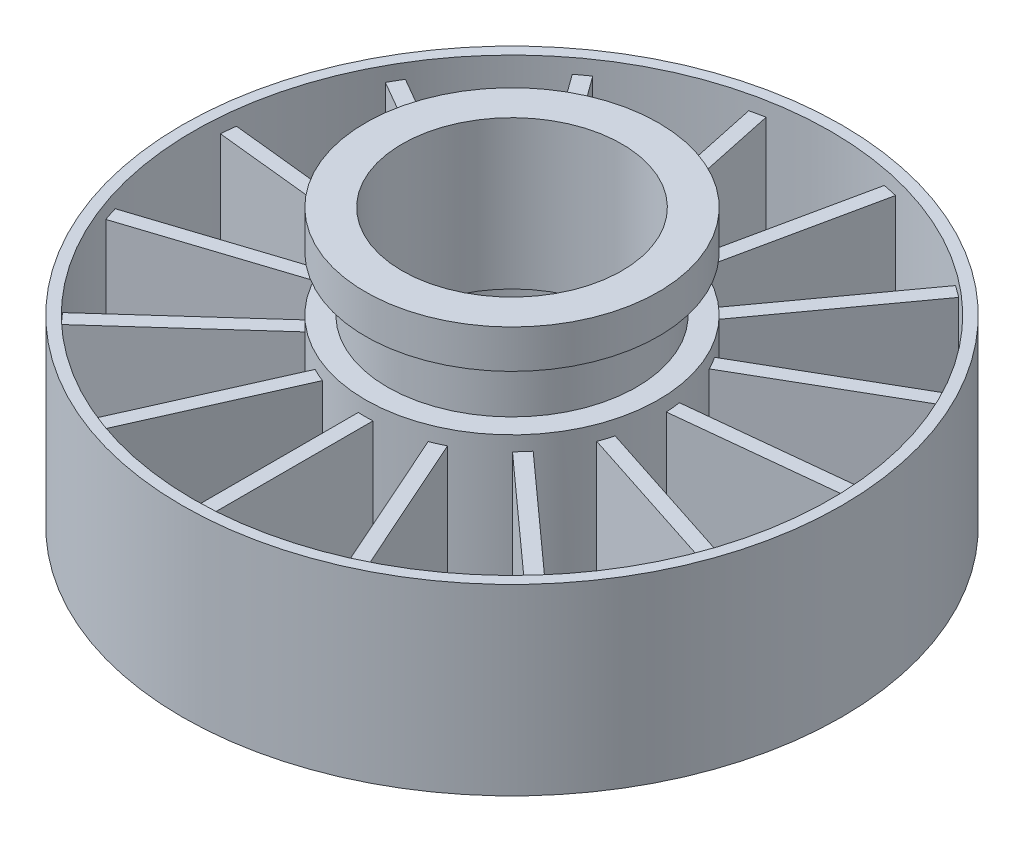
ISO-10303-21;
HEADER;
FILE_DESCRIPTION(('STEP AP214'),'2;1');
FILE_NAME('part.step','',(''),(''),'','','');
FILE_SCHEMA(('AUTOMOTIVE_DESIGN { 1 0 10303 214 1 1 1 1 }'));
ENDSEC;
DATA;
#1=APPLICATION_CONTEXT('core data for automotive mechanical design processes');
#2=APPLICATION_PROTOCOL_DEFINITION('international standard','automotive_design',2000,#1);
#3=PRODUCT_CONTEXT('',#1,'mechanical');
#4=PRODUCT('Part','Part','',(#3));
#5=PRODUCT_RELATED_PRODUCT_CATEGORY('part','',(#4));
#6=PRODUCT_DEFINITION_FORMATION('','',#4);
#7=PRODUCT_DEFINITION_CONTEXT('part definition',#1,'design');
#8=PRODUCT_DEFINITION('design','',#6,#7);
#9=PRODUCT_DEFINITION_SHAPE('','',#8);
#10=(LENGTH_UNIT() NAMED_UNIT(*) SI_UNIT(.MILLI.,.METRE.));
#11=(NAMED_UNIT(*) PLANE_ANGLE_UNIT() SI_UNIT($,.RADIAN.));
#12=(NAMED_UNIT(*) SI_UNIT($,.STERADIAN.) SOLID_ANGLE_UNIT());
#13=UNCERTAINTY_MEASURE_WITH_UNIT(LENGTH_MEASURE(1.E-05),#10,'distance_accuracy_value','');
#14=(GEOMETRIC_REPRESENTATION_CONTEXT(3) GLOBAL_UNCERTAINTY_ASSIGNED_CONTEXT((#13)) GLOBAL_UNIT_ASSIGNED_CONTEXT((#10,
#11,#12)) REPRESENTATION_CONTEXT('',''));
#15=CARTESIAN_POINT('',(0.,0.,0.));
#16=DIRECTION('',(0.,0.,1.));
#17=DIRECTION('',(1.,0.,0.));
#18=AXIS2_PLACEMENT_3D('',#15,#16,#17);
#19=CARTESIAN_POINT('',(-1.95629520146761,50.,-0.415823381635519));
#20=DIRECTION('',(-0.978147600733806,0.,-0.20791169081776));
#21=DIRECTION('',(-0.20791169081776,0.,0.978147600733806));
#22=AXIS2_PLACEMENT_3D('',#19,#20,#21);
#23=PLANE('',#22);
#24=DIRECTION('',(0.,-1.,0.));
#25=VECTOR('',#24,1.);
#26=CARTESIAN_POINT('',(16.1272416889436,304.558441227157,-85.4921755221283));
#27=LINE('',#26,#25);
#28=CARTESIAN_POINT('',(16.1272416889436,46.,-85.4921755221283));
#29=VERTEX_POINT('',#28);
#30=CARTESIAN_POINT('',(16.1272416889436,4.,-85.4921755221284));
#31=VERTEX_POINT('',#30);
#32=EDGE_CURVE('E940',#29,#31,#27,.T.);
#33=ORIENTED_EDGE('',*,*,#32,.T.);
#34=DIRECTION('',(-0.20791169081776,0.,0.978147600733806));
#35=VECTOR('',#34,1.);
#36=CARTESIAN_POINT('',(-1.95629520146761,4.,-0.415823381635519));
#37=LINE('',#36,#35);
#38=CARTESIAN_POINT('',(6.34977034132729,4.,-39.4927894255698));
#39=VERTEX_POINT('',#38);
#40=EDGE_CURVE('E919',#31,#39,#37,.T.);
#41=ORIENTED_EDGE('',*,*,#40,.T.);
#42=DIRECTION('',(0.,1.,0.));
#43=VECTOR('',#42,1.);
#44=CARTESIAN_POINT('',(6.34977034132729,0.,-39.4927894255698));
#45=LINE('',#44,#43);
#46=CARTESIAN_POINT('',(6.34977034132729,46.,-39.4927894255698));
#47=VERTEX_POINT('',#46);
#48=EDGE_CURVE('E1024',#47,#39,#45,.F.);
#49=ORIENTED_EDGE('',*,*,#48,.F.);
#50=DIRECTION('',(0.20791169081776,0.,-0.978147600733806));
#51=VECTOR('',#50,1.);
#52=CARTESIAN_POINT('',(-1.95629520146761,46.,-0.415823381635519));
#53=LINE('',#52,#51);
#54=EDGE_CURVE('E946',#47,#29,#53,.T.);
#55=ORIENTED_EDGE('',*,*,#54,.T.);
#56=EDGE_LOOP('',(#33,#41,#49,#55));
#57=FACE_BOUND('',#56,.T.);
#58=ADVANCED_FACE('F540',(#57),#23,.T.);
#59=CARTESIAN_POINT('',(1.95629520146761,50.,0.41582338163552));
#60=DIRECTION('',(0.978147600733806,0.,0.20791169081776));
#61=DIRECTION('',(0.20791169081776,0.,-0.978147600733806));
#62=AXIS2_PLACEMENT_3D('',#59,#60,#61);
#63=PLANE('',#62);
#64=DIRECTION('',(0.,1.,0.));
#65=VECTOR('',#64,1.);
#66=CARTESIAN_POINT('',(10.2623607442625,0.,-38.6611426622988));
#67=LINE('',#66,#65);
#68=CARTESIAN_POINT('',(10.2623607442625,4.,-38.6611426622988));
#69=VERTEX_POINT('',#68);
#70=CARTESIAN_POINT('',(10.2623607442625,46.,-38.6611426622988));
#71=VERTEX_POINT('',#70);
#72=EDGE_CURVE('E1022',#69,#71,#67,.T.);
#73=ORIENTED_EDGE('',*,*,#72,.F.);
#74=DIRECTION('',(0.20791169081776,0.,-0.978147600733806));
#75=VECTOR('',#74,1.);
#76=CARTESIAN_POINT('',(1.95629520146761,4.,0.41582338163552));
#77=LINE('',#76,#75);
#78=CARTESIAN_POINT('',(20.0398320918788,4.,-84.6605287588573));
#79=VERTEX_POINT('',#78);
#80=EDGE_CURVE('E1255',#69,#79,#77,.T.);
#81=ORIENTED_EDGE('',*,*,#80,.T.);
#82=DIRECTION('',(0.,-1.,0.));
#83=VECTOR('',#82,1.);
#84=CARTESIAN_POINT('',(20.0398320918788,304.558441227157,-84.6605287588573));
#85=LINE('',#84,#83);
#86=CARTESIAN_POINT('',(20.0398320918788,46.,-84.6605287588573));
#87=VERTEX_POINT('',#86);
#88=EDGE_CURVE('E941',#79,#87,#85,.F.);
#89=ORIENTED_EDGE('',*,*,#88,.T.);
#90=DIRECTION('',(-0.20791169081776,0.,0.978147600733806));
#91=VECTOR('',#90,1.);
#92=CARTESIAN_POINT('',(1.95629520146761,46.,0.41582338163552));
#93=LINE('',#92,#91);
#94=EDGE_CURVE('E1162',#87,#71,#93,.T.);
#95=ORIENTED_EDGE('',*,*,#94,.T.);
#96=EDGE_LOOP('',(#73,#81,#89,#95));
#97=FACE_BOUND('',#96,.T.);
#98=ADVANCED_FACE('F1374',(#97),#63,.T.);
#99=CARTESIAN_POINT('',(-1.61803398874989,50.,-1.17557050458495));
#100=DIRECTION('',(-0.809016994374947,0.,-0.587785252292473));
#101=DIRECTION('',(-0.587785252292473,0.,0.809016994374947));
#102=AXIS2_PLACEMENT_3D('',#99,#100,#101);
#103=PLANE('',#102);
#104=DIRECTION('',(0.,-1.,0.));
#105=VECTOR('',#104,1.);
#106=CARTESIAN_POINT('',(49.5057688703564,304.558441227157,-71.5414484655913));
#107=LINE('',#106,#105);
#108=CARTESIAN_POINT('',(49.5057688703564,46.,-71.5414484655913));
#109=VERTEX_POINT('',#108);
#110=CARTESIAN_POINT('',(49.5057688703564,4.,-71.5414484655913));
#111=VERTEX_POINT('',#110);
#112=EDGE_CURVE('E951',#109,#111,#107,.T.);
#113=ORIENTED_EDGE('',*,*,#112,.T.);
#114=DIRECTION('',(-0.587785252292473,0.,0.809016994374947));
#115=VECTOR('',#114,1.);
#116=CARTESIAN_POINT('',(-1.61803398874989,4.,-1.17557050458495));
#117=LINE('',#116,#115);
#118=CARTESIAN_POINT('',(21.863968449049,4.,-33.4957741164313));
#119=VERTEX_POINT('',#118);
#120=EDGE_CURVE('E1240',#111,#119,#117,.T.);
#121=ORIENTED_EDGE('',*,*,#120,.T.);
#122=DIRECTION('',(0.,1.,0.));
#123=VECTOR('',#122,1.);
#124=CARTESIAN_POINT('',(21.863968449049,0.,-33.4957741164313));
#125=LINE('',#124,#123);
#126=CARTESIAN_POINT('',(21.863968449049,46.,-33.4957741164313));
#127=VERTEX_POINT('',#126);
#128=EDGE_CURVE('E1019',#127,#119,#125,.F.);
#129=ORIENTED_EDGE('',*,*,#128,.F.);
#130=DIRECTION('',(0.587785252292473,0.,-0.809016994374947));
#131=VECTOR('',#130,1.);
#132=CARTESIAN_POINT('',(-1.61803398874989,46.,-1.17557050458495));
#133=LINE('',#132,#131);
#134=EDGE_CURVE('E1159',#127,#109,#133,.T.);
#135=ORIENTED_EDGE('',*,*,#134,.T.);
#136=EDGE_LOOP('',(#113,#121,#129,#135));
#137=FACE_BOUND('',#136,.T.);
#138=ADVANCED_FACE('F1238',(#137),#103,.T.);
#139=CARTESIAN_POINT('',(1.61803398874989,50.,1.17557050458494));
#140=DIRECTION('',(0.809016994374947,0.,0.587785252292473));
#141=DIRECTION('',(0.587785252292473,0.,-0.809016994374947));
#142=AXIS2_PLACEMENT_3D('',#139,#140,#141);
#143=PLANE('',#142);
#144=DIRECTION('',(0.,1.,0.));
#145=VECTOR('',#144,1.);
#146=CARTESIAN_POINT('',(25.1000364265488,0.,-31.1446331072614));
#147=LINE('',#146,#145);
#148=CARTESIAN_POINT('',(25.1000364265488,4.,-31.1446331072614));
#149=VERTEX_POINT('',#148);
#150=CARTESIAN_POINT('',(25.1000364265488,46.,-31.1446331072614));
#151=VERTEX_POINT('',#150);
#152=EDGE_CURVE('E1017',#149,#151,#147,.T.);
#153=ORIENTED_EDGE('',*,*,#152,.F.);
#154=DIRECTION('',(0.587785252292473,0.,-0.809016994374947));
#155=VECTOR('',#154,1.);
#156=CARTESIAN_POINT('',(1.61803398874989,4.,1.17557050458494));
#157=LINE('',#156,#155);
#158=CARTESIAN_POINT('',(52.7418368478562,4.,-69.1903074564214));
#159=VERTEX_POINT('',#158);
#160=EDGE_CURVE('E1261',#149,#159,#157,.T.);
#161=ORIENTED_EDGE('',*,*,#160,.T.);
#162=DIRECTION('',(0.,-1.,0.));
#163=VECTOR('',#162,1.);
#164=CARTESIAN_POINT('',(52.7418368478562,304.558441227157,-69.1903074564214));
#165=LINE('',#164,#163);
#166=CARTESIAN_POINT('',(52.7418368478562,46.,-69.1903074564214));
#167=VERTEX_POINT('',#166);
#168=EDGE_CURVE('E1233',#159,#167,#165,.F.);
#169=ORIENTED_EDGE('',*,*,#168,.T.);
#170=DIRECTION('',(-0.587785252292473,0.,0.809016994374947));
#171=VECTOR('',#170,1.);
#172=CARTESIAN_POINT('',(1.61803398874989,46.,1.17557050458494));
#173=LINE('',#172,#171);
#174=EDGE_CURVE('E1156',#167,#151,#173,.T.);
#175=ORIENTED_EDGE('',*,*,#174,.T.);
#176=EDGE_LOOP('',(#153,#161,#169,#175));
#177=FACE_BOUND('',#176,.T.);
#178=ADVANCED_FACE('F1749',(#177),#143,.T.);
#179=CARTESIAN_POINT('',(-0.209056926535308,50.,1.98904379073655));
#180=DIRECTION('',(-0.104528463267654,0.,0.994521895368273));
#181=DIRECTION('',(0.994521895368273,0.,0.104528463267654));
#182=AXIS2_PLACEMENT_3D('',#179,#180,#181);
#183=PLANE('',#182);
#184=DIRECTION('',(0.,-1.,0.));
#185=VECTOR('',#184,1.);
#186=CARTESIAN_POINT('',(-86.7095962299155,304.558441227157,-7.10252924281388));
#187=LINE('',#186,#185);
#188=CARTESIAN_POINT('',(-86.7095962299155,46.,-7.10252924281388));
#189=VERTEX_POINT('',#188);
#190=CARTESIAN_POINT('',(-86.7095962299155,4.,-7.10252924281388));
#191=VERTEX_POINT('',#190);
#192=EDGE_CURVE('E1230',#189,#191,#187,.T.);
#193=ORIENTED_EDGE('',*,*,#192,.T.);
#194=DIRECTION('',(0.994521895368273,0.,0.104528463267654));
#195=VECTOR('',#194,1.);
#196=CARTESIAN_POINT('',(-0.209056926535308,4.,1.98904379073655));
#197=LINE('',#196,#195);
#198=CARTESIAN_POINT('',(-39.9401755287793,4.,-2.18686504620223));
#199=VERTEX_POINT('',#198);
#200=EDGE_CURVE('E1322',#191,#199,#197,.T.);
#201=ORIENTED_EDGE('',*,*,#200,.T.);
#202=DIRECTION('',(0.,1.,0.));
#203=VECTOR('',#202,1.);
#204=CARTESIAN_POINT('',(-39.9401755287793,0.,-2.18686504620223));
#205=LINE('',#204,#203);
#206=CARTESIAN_POINT('',(-39.9401755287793,46.,-2.18686504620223));
#207=VERTEX_POINT('',#206);
#208=EDGE_CURVE('E1012',#207,#199,#205,.F.);
#209=ORIENTED_EDGE('',*,*,#208,.F.);
#210=DIRECTION('',(-0.994521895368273,0.,-0.104528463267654));
#211=VECTOR('',#210,1.);
#212=CARTESIAN_POINT('',(-0.209056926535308,46.,1.98904379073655));
#213=LINE('',#212,#211);
#214=EDGE_CURVE('E1153',#207,#189,#213,.T.);
#215=ORIENTED_EDGE('',*,*,#214,.T.);
#216=EDGE_LOOP('',(#193,#201,#209,#215));
#217=FACE_BOUND('',#216,.T.);
#218=ADVANCED_FACE('F1741',(#217),#183,.T.);
#219=CARTESIAN_POINT('',(0.209056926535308,50.,-1.98904379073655));
#220=DIRECTION('',(0.104528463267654,0.,-0.994521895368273));
#221=DIRECTION('',(-0.994521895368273,0.,-0.104528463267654));
#222=AXIS2_PLACEMENT_3D('',#219,#220,#221);
#223=PLANE('',#222);
#224=DIRECTION('',(0.,1.,0.));
#225=VECTOR('',#224,1.);
#226=CARTESIAN_POINT('',(-39.5220616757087,0.,-6.16495262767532));
#227=LINE('',#226,#225);
#228=CARTESIAN_POINT('',(-39.5220616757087,4.,-6.16495262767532));
#229=VERTEX_POINT('',#228);
#230=CARTESIAN_POINT('',(-39.5220616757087,46.,-6.16495262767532));
#231=VERTEX_POINT('',#230);
#232=EDGE_CURVE('E1015',#229,#231,#227,.T.);
#233=ORIENTED_EDGE('',*,*,#232,.F.);
#234=DIRECTION('',(-0.994521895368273,0.,-0.104528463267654));
#235=VECTOR('',#234,1.);
#236=CARTESIAN_POINT('',(0.209056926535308,4.,-1.98904379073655));
#237=LINE('',#236,#235);
#238=CARTESIAN_POINT('',(-86.2914823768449,4.,-11.080616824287));
#239=VERTEX_POINT('',#238);
#240=EDGE_CURVE('E1329',#229,#239,#237,.T.);
#241=ORIENTED_EDGE('',*,*,#240,.T.);
#242=DIRECTION('',(0.,-1.,0.));
#243=VECTOR('',#242,1.);
#244=CARTESIAN_POINT('',(-86.2914823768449,304.558441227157,-11.080616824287));
#245=LINE('',#244,#243);
#246=CARTESIAN_POINT('',(-86.2914823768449,46.,-11.080616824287));
#247=VERTEX_POINT('',#246);
#248=EDGE_CURVE('E1228',#239,#247,#245,.F.);
#249=ORIENTED_EDGE('',*,*,#248,.T.);
#250=DIRECTION('',(0.994521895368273,0.,0.104528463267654));
#251=VECTOR('',#250,1.);
#252=CARTESIAN_POINT('',(0.209056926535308,46.,-1.98904379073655));
#253=LINE('',#252,#251);
#254=EDGE_CURVE('E1150',#247,#231,#253,.T.);
#255=ORIENTED_EDGE('',*,*,#254,.T.);
#256=EDGE_LOOP('',(#233,#241,#249,#255));
#257=FACE_BOUND('',#256,.T.);
#258=ADVANCED_FACE('F1733',(#257),#223,.T.);
#259=CARTESIAN_POINT('',(-1.,50.,1.73205080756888));
#260=DIRECTION('',(-0.5,0.,0.866025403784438));
#261=DIRECTION('',(0.866025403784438,0.,0.5));
#262=AXIS2_PLACEMENT_3D('',#259,#260,#261);
#263=PLANE('',#262);
#264=DIRECTION('',(0.,-1.,0.));
#265=VECTOR('',#264,1.);
#266=CARTESIAN_POINT('',(-76.3242988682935,304.558441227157,-41.7564534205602));
#267=LINE('',#266,#265);
#268=CARTESIAN_POINT('',(-76.3242988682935,46.,-41.7564534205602));
#269=VERTEX_POINT('',#268);
#270=CARTESIAN_POINT('',(-76.3242988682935,4.,-41.7564534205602));
#271=VERTEX_POINT('',#270);
#272=EDGE_CURVE('E1225',#269,#271,#267,.T.);
#273=ORIENTED_EDGE('',*,*,#272,.T.);
#274=DIRECTION('',(0.866025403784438,0.,0.5));
#275=VECTOR('',#274,1.);
#276=CARTESIAN_POINT('',(-1.,4.,1.73205080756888));
#277=LINE('',#276,#275);
#278=CARTESIAN_POINT('',(-35.5976877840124,4.,-18.2429335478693));
#279=VERTEX_POINT('',#278);
#280=EDGE_CURVE('E1326',#271,#279,#277,.T.);
#281=ORIENTED_EDGE('',*,*,#280,.T.);
#282=DIRECTION('',(0.,1.,0.));
#283=VECTOR('',#282,1.);
#284=CARTESIAN_POINT('',(-35.5976877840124,0.,-18.2429335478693));
#285=LINE('',#284,#283);
#286=CARTESIAN_POINT('',(-35.5976877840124,46.,-18.2429335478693));
#287=VERTEX_POINT('',#286);
#288=EDGE_CURVE('E1007',#287,#279,#285,.F.);
#289=ORIENTED_EDGE('',*,*,#288,.F.);
#290=DIRECTION('',(-0.866025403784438,0.,-0.5));
#291=VECTOR('',#290,1.);
#292=CARTESIAN_POINT('',(-1.,46.,1.73205080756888));
#293=LINE('',#292,#291);
#294=EDGE_CURVE('E1147',#287,#269,#293,.T.);
#295=ORIENTED_EDGE('',*,*,#294,.T.);
#296=EDGE_LOOP('',(#273,#281,#289,#295));
#297=FACE_BOUND('',#296,.T.);
#298=ADVANCED_FACE('F1725',(#297),#263,.T.);
#299=CARTESIAN_POINT('',(1.,50.,-1.73205080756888));
#300=DIRECTION('',(0.5,0.,-0.866025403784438));
#301=DIRECTION('',(-0.866025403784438,0.,-0.5));
#302=AXIS2_PLACEMENT_3D('',#299,#300,#301);
#303=PLANE('',#302);
#304=DIRECTION('',(0.,1.,0.));
#305=VECTOR('',#304,1.);
#306=CARTESIAN_POINT('',(-33.5976877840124,0.,-21.7070351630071));
#307=LINE('',#306,#305);
#308=CARTESIAN_POINT('',(-33.5976877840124,4.,-21.7070351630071));
#309=VERTEX_POINT('',#308);
#310=CARTESIAN_POINT('',(-33.5976877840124,46.,-21.7070351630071));
#311=VERTEX_POINT('',#310);
#312=EDGE_CURVE('E1010',#309,#311,#307,.T.);
#313=ORIENTED_EDGE('',*,*,#312,.F.);
#314=DIRECTION('',(-0.866025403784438,0.,-0.5));
#315=VECTOR('',#314,1.);
#316=CARTESIAN_POINT('',(1.,4.,-1.73205080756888));
#317=LINE('',#316,#315);
#318=CARTESIAN_POINT('',(-74.3242988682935,4.,-45.220555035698));
#319=VERTEX_POINT('',#318);
#320=EDGE_CURVE('E1336',#309,#319,#317,.T.);
#321=ORIENTED_EDGE('',*,*,#320,.T.);
#322=DIRECTION('',(0.,-1.,0.));
#323=VECTOR('',#322,1.);
#324=CARTESIAN_POINT('',(-74.3242988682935,304.558441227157,-45.220555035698));
#325=LINE('',#324,#323);
#326=CARTESIAN_POINT('',(-74.3242988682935,46.,-45.220555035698));
#327=VERTEX_POINT('',#326);
#328=EDGE_CURVE('E1223',#319,#327,#325,.F.);
#329=ORIENTED_EDGE('',*,*,#328,.T.);
#330=DIRECTION('',(0.866025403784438,0.,0.5));
#331=VECTOR('',#330,1.);
#332=CARTESIAN_POINT('',(1.,46.,-1.73205080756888));
#333=LINE('',#332,#331);
#334=EDGE_CURVE('E1144',#327,#311,#333,.T.);
#335=ORIENTED_EDGE('',*,*,#334,.T.);
#336=EDGE_LOOP('',(#313,#321,#329,#335));
#337=FACE_BOUND('',#336,.T.);
#338=ADVANCED_FACE('F1717',(#337),#303,.T.);
#339=CARTESIAN_POINT('',(-1.61803398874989,50.,1.17557050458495));
#340=DIRECTION('',(-0.809016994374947,0.,0.587785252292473));
#341=DIRECTION('',(0.587785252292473,0.,0.809016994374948));
#342=AXIS2_PLACEMENT_3D('',#339,#340,#341);
#343=PLANE('',#342);
#344=DIRECTION('',(0.,-1.,0.));
#345=VECTOR('',#344,1.);
#346=CARTESIAN_POINT('',(-52.7418368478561,304.558441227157,-69.1903074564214));
#347=LINE('',#346,#345);
#348=CARTESIAN_POINT('',(-52.7418368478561,46.,-69.1903074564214));
#349=VERTEX_POINT('',#348);
#350=CARTESIAN_POINT('',(-52.7418368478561,4.,-69.1903074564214));
#351=VERTEX_POINT('',#350);
#352=EDGE_CURVE('E1220',#349,#351,#347,.T.);
#353=ORIENTED_EDGE('',*,*,#352,.T.);
#354=DIRECTION('',(0.587785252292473,0.,0.809016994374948));
#355=VECTOR('',#354,1.);
#356=CARTESIAN_POINT('',(-1.61803398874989,4.,1.17557050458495));
#357=LINE('',#356,#355);
#358=CARTESIAN_POINT('',(-25.1000364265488,4.,-31.1446331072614));
#359=VERTEX_POINT('',#358);
#360=EDGE_CURVE('E1333',#351,#359,#357,.T.);
#361=ORIENTED_EDGE('',*,*,#360,.T.);
#362=DIRECTION('',(0.,1.,0.));
#363=VECTOR('',#362,1.);
#364=CARTESIAN_POINT('',(-25.1000364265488,0.,-31.1446331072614));
#365=LINE('',#364,#363);
#366=CARTESIAN_POINT('',(-25.1000364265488,46.,-31.1446331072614));
#367=VERTEX_POINT('',#366);
#368=EDGE_CURVE('E1004',#367,#359,#365,.F.);
#369=ORIENTED_EDGE('',*,*,#368,.F.);
#370=DIRECTION('',(-0.587785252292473,0.,-0.809016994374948));
#371=VECTOR('',#370,1.);
#372=CARTESIAN_POINT('',(-1.61803398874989,46.,1.17557050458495));
#373=LINE('',#372,#371);
#374=EDGE_CURVE('E1141',#367,#349,#373,.T.);
#375=ORIENTED_EDGE('',*,*,#374,.T.);
#376=EDGE_LOOP('',(#353,#361,#369,#375));
#377=FACE_BOUND('',#376,.T.);
#378=ADVANCED_FACE('F1709',(#377),#343,.T.);
#379=CARTESIAN_POINT('',(1.61803398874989,50.,-1.17557050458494));
#380=DIRECTION('',(0.809016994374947,0.,-0.587785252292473));
#381=DIRECTION('',(-0.587785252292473,0.,-0.809016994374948));
#382=AXIS2_PLACEMENT_3D('',#379,#380,#381);
#383=PLANE('',#382);
#384=DIRECTION('',(0.,1.,0.));
#385=VECTOR('',#384,1.);
#386=CARTESIAN_POINT('',(-21.863968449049,0.,-33.4957741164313));
#387=LINE('',#386,#385);
#388=CARTESIAN_POINT('',(-21.863968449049,4.,-33.4957741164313));
#389=VERTEX_POINT('',#388);
#390=CARTESIAN_POINT('',(-21.863968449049,46.,-33.4957741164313));
#391=VERTEX_POINT('',#390);
#392=EDGE_CURVE('E1002',#389,#391,#387,.T.);
#393=ORIENTED_EDGE('',*,*,#392,.F.);
#394=DIRECTION('',(-0.587785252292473,0.,-0.809016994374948));
#395=VECTOR('',#394,1.);
#396=CARTESIAN_POINT('',(1.61803398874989,4.,-1.17557050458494));
#397=LINE('',#396,#395);
#398=CARTESIAN_POINT('',(-49.5057688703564,4.,-71.5414484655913));
#399=VERTEX_POINT('',#398);
#400=EDGE_CURVE('E1066',#389,#399,#397,.T.);
#401=ORIENTED_EDGE('',*,*,#400,.T.);
#402=DIRECTION('',(0.,-1.,0.));
#403=VECTOR('',#402,1.);
#404=CARTESIAN_POINT('',(-49.5057688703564,304.558441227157,-71.5414484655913));
#405=LINE('',#404,#403);
#406=CARTESIAN_POINT('',(-49.5057688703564,46.,-71.5414484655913));
#407=VERTEX_POINT('',#406);
#408=EDGE_CURVE('E1218',#399,#407,#405,.F.);
#409=ORIENTED_EDGE('',*,*,#408,.T.);
#410=DIRECTION('',(0.587785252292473,0.,0.809016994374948));
#411=VECTOR('',#410,1.);
#412=CARTESIAN_POINT('',(1.61803398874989,46.,-1.17557050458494));
#413=LINE('',#412,#411);
#414=EDGE_CURVE('E1138',#407,#391,#413,.T.);
#415=ORIENTED_EDGE('',*,*,#414,.T.);
#416=EDGE_LOOP('',(#393,#401,#409,#415));
#417=FACE_BOUND('',#416,.T.);
#418=ADVANCED_FACE('F1701',(#417),#383,.T.);
#419=CARTESIAN_POINT('',(2.,50.,0.));
#420=DIRECTION('',(1.,0.,0.));
#421=DIRECTION('',(0.,0.,-1.));
#422=AXIS2_PLACEMENT_3D('',#419,#420,#421);
#423=PLANE('',#422);
#424=DIRECTION('',(0.,-1.,0.));
#425=VECTOR('',#424,1.);
#426=CARTESIAN_POINT('',(2.,304.558441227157,86.9770084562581));
#427=LINE('',#426,#425);
#428=CARTESIAN_POINT('',(2.,46.,86.9770084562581));
#429=VERTEX_POINT('',#428);
#430=CARTESIAN_POINT('',(2.,4.,86.9770084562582));
#431=VERTEX_POINT('',#430);
#432=EDGE_CURVE('E1215',#429,#431,#427,.T.);
#433=ORIENTED_EDGE('',*,*,#432,.T.);
#434=DIRECTION('',(0.,0.,-1.));
#435=VECTOR('',#434,1.);
#436=CARTESIAN_POINT('',(2.,4.,0.));
#437=LINE('',#436,#435);
#438=CARTESIAN_POINT('',(2.,4.,39.9499687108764));
#439=VERTEX_POINT('',#438);
#440=EDGE_CURVE('E1295',#431,#439,#437,.T.);
#441=ORIENTED_EDGE('',*,*,#440,.T.);
#442=DIRECTION('',(0.,1.,0.));
#443=VECTOR('',#442,1.);
#444=CARTESIAN_POINT('',(2.,0.,39.9499687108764));
#445=LINE('',#444,#443);
#446=CARTESIAN_POINT('',(2.,46.,39.9499687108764));
#447=VERTEX_POINT('',#446);
#448=EDGE_CURVE('E997',#447,#439,#445,.F.);
#449=ORIENTED_EDGE('',*,*,#448,.F.);
#450=DIRECTION('',(0.,0.,1.));
#451=VECTOR('',#450,1.);
#452=CARTESIAN_POINT('',(2.,46.,0.));
#453=LINE('',#452,#451);
#454=EDGE_CURVE('E1135',#447,#429,#453,.T.);
#455=ORIENTED_EDGE('',*,*,#454,.T.);
#456=EDGE_LOOP('',(#433,#441,#449,#455));
#457=FACE_BOUND('',#456,.T.);
#458=ADVANCED_FACE('F1694',(#457),#423,.T.);
#459=CARTESIAN_POINT('',(-2.,50.,0.));
#460=DIRECTION('',(-1.,0.,0.));
#461=DIRECTION('',(0.,0.,1.));
#462=AXIS2_PLACEMENT_3D('',#459,#460,#461);
#463=PLANE('',#462);
#464=DIRECTION('',(0.,1.,0.));
#465=VECTOR('',#464,1.);
#466=CARTESIAN_POINT('',(-2.,0.,39.9499687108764));
#467=LINE('',#466,#465);
#468=CARTESIAN_POINT('',(-2.,4.,39.9499687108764));
#469=VERTEX_POINT('',#468);
#470=CARTESIAN_POINT('',(-2.,46.,39.9499687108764));
#471=VERTEX_POINT('',#470);
#472=EDGE_CURVE('E1000',#469,#471,#467,.T.);
#473=ORIENTED_EDGE('',*,*,#472,.F.);
#474=DIRECTION('',(0.,0.,1.));
#475=VECTOR('',#474,1.);
#476=CARTESIAN_POINT('',(-2.,4.,0.));
#477=LINE('',#476,#475);
#478=CARTESIAN_POINT('',(-2.,4.,86.9770084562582));
#479=VERTEX_POINT('',#478);
#480=EDGE_CURVE('E1302',#469,#479,#477,.T.);
#481=ORIENTED_EDGE('',*,*,#480,.T.);
#482=DIRECTION('',(0.,-1.,0.));
#483=VECTOR('',#482,1.);
#484=CARTESIAN_POINT('',(-2.,304.558441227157,86.9770084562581));
#485=LINE('',#484,#483);
#486=CARTESIAN_POINT('',(-2.,46.,86.9770084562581));
#487=VERTEX_POINT('',#486);
#488=EDGE_CURVE('E555',#479,#487,#485,.F.);
#489=ORIENTED_EDGE('',*,*,#488,.T.);
#490=DIRECTION('',(0.,0.,-1.));
#491=VECTOR('',#490,1.);
#492=CARTESIAN_POINT('',(-2.,46.,0.));
#493=LINE('',#492,#491);
#494=EDGE_CURVE('E1133',#487,#471,#493,.T.);
#495=ORIENTED_EDGE('',*,*,#494,.T.);
#496=EDGE_LOOP('',(#473,#481,#489,#495));
#497=FACE_BOUND('',#496,.T.);
#498=ADVANCED_FACE('F1686',(#497),#463,.T.);
#499=CARTESIAN_POINT('',(0.618033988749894,50.,1.90211303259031));
#500=DIRECTION('',(0.309016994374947,0.,0.951056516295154));
#501=DIRECTION('',(0.951056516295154,0.,-0.309016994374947));
#502=AXIS2_PLACEMENT_3D('',#499,#500,#501);
#503=PLANE('',#502);
#504=DIRECTION('',(0.,-1.,0.));
#505=VECTOR('',#504,1.);
#506=CARTESIAN_POINT('',(-82.1020166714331,304.558441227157,28.7794867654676));
#507=LINE('',#506,#505);
#508=CARTESIAN_POINT('',(-82.1020166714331,46.,28.7794867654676));
#509=VERTEX_POINT('',#508);
#510=CARTESIAN_POINT('',(-82.1020166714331,4.,28.7794867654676));
#511=VERTEX_POINT('',#510);
#512=EDGE_CURVE('E1211',#509,#511,#507,.T.);
#513=ORIENTED_EDGE('',*,*,#512,.T.);
#514=DIRECTION('',(0.951056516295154,0.,-0.309016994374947));
#515=VECTOR('',#514,1.);
#516=CARTESIAN_POINT('',(0.618033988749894,4.,1.90211303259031));
#517=LINE('',#516,#515);
#518=CARTESIAN_POINT('',(-37.3766440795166,4.,14.2473322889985));
#519=VERTEX_POINT('',#518);
#520=EDGE_CURVE('E1315',#511,#519,#517,.T.);
#521=ORIENTED_EDGE('',*,*,#520,.T.);
#522=DIRECTION('',(0.,1.,0.));
#523=VECTOR('',#522,1.);
#524=CARTESIAN_POINT('',(-37.3766440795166,0.,14.2473322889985));
#525=LINE('',#524,#523);
#526=CARTESIAN_POINT('',(-37.3766440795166,46.,14.2473322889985));
#527=VERTEX_POINT('',#526);
#528=EDGE_CURVE('E994',#527,#519,#525,.F.);
#529=ORIENTED_EDGE('',*,*,#528,.F.);
#530=DIRECTION('',(-0.951056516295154,0.,0.309016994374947));
#531=VECTOR('',#530,1.);
#532=CARTESIAN_POINT('',(0.618033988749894,46.,1.90211303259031));
#533=LINE('',#532,#531);
#534=EDGE_CURVE('E1130',#527,#509,#533,.T.);
#535=ORIENTED_EDGE('',*,*,#534,.T.);
#536=EDGE_LOOP('',(#513,#521,#529,#535));
#537=FACE_BOUND('',#536,.T.);
#538=ADVANCED_FACE('F1678',(#537),#503,.T.);
#539=CARTESIAN_POINT('',(-0.618033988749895,50.,-1.90211303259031));
#540=DIRECTION('',(-0.309016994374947,0.,-0.951056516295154));
#541=DIRECTION('',(-0.951056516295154,0.,0.309016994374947));
#542=AXIS2_PLACEMENT_3D('',#539,#540,#541);
#543=PLANE('',#542);
#544=DIRECTION('',(0.,1.,0.));
#545=VECTOR('',#544,1.);
#546=CARTESIAN_POINT('',(-38.6127120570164,0.,10.4431062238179));
#547=LINE('',#546,#545);
#548=CARTESIAN_POINT('',(-38.6127120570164,4.,10.4431062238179));
#549=VERTEX_POINT('',#548);
#550=CARTESIAN_POINT('',(-38.6127120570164,46.,10.4431062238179));
#551=VERTEX_POINT('',#550);
#552=EDGE_CURVE('E992',#549,#551,#547,.T.);
#553=ORIENTED_EDGE('',*,*,#552,.F.);
#554=DIRECTION('',(-0.951056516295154,0.,0.309016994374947));
#555=VECTOR('',#554,1.);
#556=CARTESIAN_POINT('',(-0.618033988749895,4.,-1.90211303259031));
#557=LINE('',#556,#555);
#558=CARTESIAN_POINT('',(-83.3380846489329,4.,24.975260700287));
#559=VERTEX_POINT('',#558);
#560=EDGE_CURVE('E1319',#549,#559,#557,.T.);
#561=ORIENTED_EDGE('',*,*,#560,.T.);
#562=DIRECTION('',(0.,-1.,0.));
#563=VECTOR('',#562,1.);
#564=CARTESIAN_POINT('',(-83.3380846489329,304.558441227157,24.9752607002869));
#565=LINE('',#564,#563);
#566=CARTESIAN_POINT('',(-83.3380846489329,46.,24.9752607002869));
#567=VERTEX_POINT('',#566);
#568=EDGE_CURVE('E1209',#559,#567,#565,.F.);
#569=ORIENTED_EDGE('',*,*,#568,.T.);
#570=DIRECTION('',(0.951056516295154,0.,-0.309016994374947));
#571=VECTOR('',#570,1.);
#572=CARTESIAN_POINT('',(-0.618033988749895,46.,-1.90211303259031));
#573=LINE('',#572,#571);
#574=EDGE_CURVE('E1127',#567,#551,#573,.T.);
#575=ORIENTED_EDGE('',*,*,#574,.T.);
#576=EDGE_LOOP('',(#553,#561,#569,#575));
#577=FACE_BOUND('',#576,.T.);
#578=ADVANCED_FACE('F1671',(#577),#543,.T.);
#579=CARTESIAN_POINT('',(1.8270909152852,50.,0.813473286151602));
#580=DIRECTION('',(0.913545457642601,0.,0.406736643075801));
#581=DIRECTION('',(0.406736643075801,0.,-0.913545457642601));
#582=AXIS2_PLACEMENT_3D('',#579,#580,#581);
#583=PLANE('',#582);
#584=DIRECTION('',(0.,-1.,0.));
#585=VECTOR('',#584,1.);
#586=CARTESIAN_POINT('',(-33.5496455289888,304.558441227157,80.2709242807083));
#587=LINE('',#586,#585);
#588=CARTESIAN_POINT('',(-33.5496455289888,46.,80.2709242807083));
#589=VERTEX_POINT('',#588);
#590=CARTESIAN_POINT('',(-33.5496455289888,4.,80.2709242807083));
#591=VERTEX_POINT('',#590);
#592=EDGE_CURVE('E1206',#589,#591,#587,.T.);
#593=ORIENTED_EDGE('',*,*,#592,.T.);
#594=DIRECTION('',(0.406736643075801,0.,-0.913545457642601));
#595=VECTOR('',#594,1.);
#596=CARTESIAN_POINT('',(1.8270909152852,4.,0.813473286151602));
#597=LINE('',#596,#595);
#598=CARTESIAN_POINT('',(-14.4220252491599,4.,37.3095857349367));
#599=VERTEX_POINT('',#598);
#600=EDGE_CURVE('E1299',#591,#599,#597,.T.);
#601=ORIENTED_EDGE('',*,*,#600,.T.);
#602=DIRECTION('',(0.,1.,0.));
#603=VECTOR('',#602,1.);
#604=CARTESIAN_POINT('',(-14.4220252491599,0.,37.3095857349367));
#605=LINE('',#604,#603);
#606=CARTESIAN_POINT('',(-14.4220252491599,46.,37.3095857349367));
#607=VERTEX_POINT('',#606);
#608=EDGE_CURVE('E987',#607,#599,#605,.F.);
#609=ORIENTED_EDGE('',*,*,#608,.F.);
#610=DIRECTION('',(-0.406736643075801,0.,0.913545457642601));
#611=VECTOR('',#610,1.);
#612=CARTESIAN_POINT('',(1.8270909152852,46.,0.813473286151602));
#613=LINE('',#612,#611);
#614=EDGE_CURVE('E1125',#607,#589,#613,.T.);
#615=ORIENTED_EDGE('',*,*,#614,.T.);
#616=EDGE_LOOP('',(#593,#601,#609,#615));
#617=FACE_BOUND('',#616,.T.);
#618=ADVANCED_FACE('F1461',(#617),#583,.T.);
#619=CARTESIAN_POINT('',(-1.8270909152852,50.,-0.813473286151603));
#620=DIRECTION('',(-0.913545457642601,0.,-0.406736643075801));
#621=DIRECTION('',(-0.406736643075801,0.,0.913545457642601));
#622=AXIS2_PLACEMENT_3D('',#619,#620,#621);
#623=PLANE('',#622);
#624=DIRECTION('',(0.,1.,0.));
#625=VECTOR('',#624,1.);
#626=CARTESIAN_POINT('',(-18.0762070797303,0.,35.6826391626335));
#627=LINE('',#626,#625);
#628=CARTESIAN_POINT('',(-18.0762070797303,4.,35.6826391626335));
#629=VERTEX_POINT('',#628);
#630=CARTESIAN_POINT('',(-18.0762070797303,46.,35.6826391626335));
#631=VERTEX_POINT('',#630);
#632=EDGE_CURVE('E990',#629,#631,#627,.T.);
#633=ORIENTED_EDGE('',*,*,#632,.F.);
#634=DIRECTION('',(-0.406736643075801,0.,0.913545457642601));
#635=VECTOR('',#634,1.);
#636=CARTESIAN_POINT('',(-1.8270909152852,4.,-0.813473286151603));
#637=LINE('',#636,#635);
#638=CARTESIAN_POINT('',(-37.2038273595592,4.,78.6439777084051));
#639=VERTEX_POINT('',#638);
#640=EDGE_CURVE('E1308',#629,#639,#637,.T.);
#641=ORIENTED_EDGE('',*,*,#640,.T.);
#642=DIRECTION('',(0.,-1.,0.));
#643=VECTOR('',#642,1.);
#644=CARTESIAN_POINT('',(-37.2038273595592,304.558441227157,78.6439777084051));
#645=LINE('',#644,#643);
#646=CARTESIAN_POINT('',(-37.2038273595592,46.,78.6439777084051));
#647=VERTEX_POINT('',#646);
#648=EDGE_CURVE('E1204',#639,#647,#645,.F.);
#649=ORIENTED_EDGE('',*,*,#648,.T.);
#650=DIRECTION('',(0.406736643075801,0.,-0.913545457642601));
#651=VECTOR('',#650,1.);
#652=CARTESIAN_POINT('',(-1.8270909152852,46.,-0.813473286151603));
#653=LINE('',#652,#651);
#654=EDGE_CURVE('E1122',#647,#631,#653,.T.);
#655=ORIENTED_EDGE('',*,*,#654,.T.);
#656=EDGE_LOOP('',(#633,#641,#649,#655));
#657=FACE_BOUND('',#656,.T.);
#658=ADVANCED_FACE('F1467',(#657),#623,.T.);
#659=CARTESIAN_POINT('',(1.33826121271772,50.,1.48628965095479));
#660=DIRECTION('',(0.669130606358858,0.,0.743144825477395));
#661=DIRECTION('',(0.743144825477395,0.,-0.669130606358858));
#662=AXIS2_PLACEMENT_3D('',#659,#660,#661);
#663=PLANE('',#662);
#664=DIRECTION('',(0.,-1.,0.));
#665=VECTOR('',#664,1.);
#666=CARTESIAN_POINT('',(-63.2982525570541,304.558441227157,59.6852680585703));
#667=LINE('',#666,#665);
#668=CARTESIAN_POINT('',(-63.2982525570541,46.,59.6852680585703));
#669=VERTEX_POINT('',#668);
#670=CARTESIAN_POINT('',(-63.2982525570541,4.,59.6852680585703));
#671=VERTEX_POINT('',#670);
#672=EDGE_CURVE('E1201',#669,#671,#667,.T.);
#673=ORIENTED_EDGE('',*,*,#672,.T.);
#674=DIRECTION('',(0.743144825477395,0.,-0.669130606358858));
#675=VECTOR('',#674,1.);
#676=CARTESIAN_POINT('',(1.33826121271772,4.,1.48628965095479));
#677=LINE('',#676,#675);
#678=CARTESIAN_POINT('',(-28.3503513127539,4.,28.2180364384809));
#679=VERTEX_POINT('',#678);
#680=EDGE_CURVE('E1305',#671,#679,#677,.T.);
#681=ORIENTED_EDGE('',*,*,#680,.T.);
#682=DIRECTION('',(0.,1.,0.));
#683=VECTOR('',#682,1.);
#684=CARTESIAN_POINT('',(-28.3503513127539,0.,28.2180364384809));
#685=LINE('',#684,#683);
#686=CARTESIAN_POINT('',(-28.3503513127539,46.,28.2180364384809));
#687=VERTEX_POINT('',#686);
#688=EDGE_CURVE('E984',#687,#679,#685,.F.);
#689=ORIENTED_EDGE('',*,*,#688,.F.);
#690=DIRECTION('',(-0.743144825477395,0.,0.669130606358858));
#691=VECTOR('',#690,1.);
#692=CARTESIAN_POINT('',(1.33826121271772,46.,1.48628965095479));
#693=LINE('',#692,#691);
#694=EDGE_CURVE('E1119',#687,#669,#693,.T.);
#695=ORIENTED_EDGE('',*,*,#694,.T.);
#696=EDGE_LOOP('',(#673,#681,#689,#695));
#697=FACE_BOUND('',#696,.T.);
#698=ADVANCED_FACE('F1413',(#697),#663,.T.);
#699=CARTESIAN_POINT('',(-1.33826121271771,50.,-1.48628965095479));
#700=DIRECTION('',(-0.669130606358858,0.,-0.743144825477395));
#701=DIRECTION('',(-0.743144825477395,0.,0.669130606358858));
#702=AXIS2_PLACEMENT_3D('',#699,#700,#701);
#703=PLANE('',#702);
#704=DIRECTION('',(0.,1.,0.));
#705=VECTOR('',#704,1.);
#706=CARTESIAN_POINT('',(-31.0268737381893,0.,25.2454571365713));
#707=LINE('',#706,#705);
#708=CARTESIAN_POINT('',(-31.0268737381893,4.,25.2454571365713));
#709=VERTEX_POINT('',#708);
#710=CARTESIAN_POINT('',(-31.0268737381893,46.,25.2454571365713));
#711=VERTEX_POINT('',#710);
#712=EDGE_CURVE('E982',#709,#711,#707,.T.);
#713=ORIENTED_EDGE('',*,*,#712,.F.);
#714=DIRECTION('',(-0.743144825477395,0.,0.669130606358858));
#715=VECTOR('',#714,1.);
#716=CARTESIAN_POINT('',(-1.33826121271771,4.,-1.48628965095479));
#717=LINE('',#716,#715);
#718=CARTESIAN_POINT('',(-65.9747749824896,4.,56.7126887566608));
#719=VERTEX_POINT('',#718);
#720=EDGE_CURVE('E1312',#709,#719,#717,.T.);
#721=ORIENTED_EDGE('',*,*,#720,.T.);
#722=DIRECTION('',(0.,-1.,0.));
#723=VECTOR('',#722,1.);
#724=CARTESIAN_POINT('',(-65.9747749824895,304.558441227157,56.7126887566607));
#725=LINE('',#724,#723);
#726=CARTESIAN_POINT('',(-65.9747749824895,46.,56.7126887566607));
#727=VERTEX_POINT('',#726);
#728=EDGE_CURVE('E1199',#719,#727,#725,.F.);
#729=ORIENTED_EDGE('',*,*,#728,.T.);
#730=DIRECTION('',(0.743144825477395,0.,-0.669130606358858));
#731=VECTOR('',#730,1.);
#732=CARTESIAN_POINT('',(-1.33826121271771,46.,-1.48628965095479));
#733=LINE('',#732,#731);
#734=EDGE_CURVE('E1116',#727,#711,#733,.T.);
#735=ORIENTED_EDGE('',*,*,#734,.T.);
#736=EDGE_LOOP('',(#713,#721,#729,#735));
#737=FACE_BOUND('',#736,.T.);
#738=ADVANCED_FACE('F1644',(#737),#703,.T.);
#739=CARTESIAN_POINT('',(-1.,50.,-1.73205080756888));
#740=DIRECTION('',(-0.5,0.,-0.866025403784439));
#741=DIRECTION('',(-0.866025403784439,0.,0.5));
#742=AXIS2_PLACEMENT_3D('',#739,#740,#741);
#743=PLANE('',#742);
#744=DIRECTION('',(0.,-1.,0.));
#745=VECTOR('',#744,1.);
#746=CARTESIAN_POINT('',(74.3242988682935,304.558441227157,-45.2205550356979));
#747=LINE('',#746,#745);
#748=CARTESIAN_POINT('',(74.3242988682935,46.,-45.2205550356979));
#749=VERTEX_POINT('',#748);
#750=CARTESIAN_POINT('',(74.3242988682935,4.,-45.2205550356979));
#751=VERTEX_POINT('',#750);
#752=EDGE_CURVE('E1196',#749,#751,#747,.T.);
#753=ORIENTED_EDGE('',*,*,#752,.T.);
#754=DIRECTION('',(-0.866025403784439,0.,0.5));
#755=VECTOR('',#754,1.);
#756=CARTESIAN_POINT('',(-1.,4.,-1.73205080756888));
#757=LINE('',#756,#755);
#758=CARTESIAN_POINT('',(33.5976877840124,4.,-21.707035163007));
#759=VERTEX_POINT('',#758);
#760=EDGE_CURVE('E1258',#751,#759,#757,.T.);
#761=ORIENTED_EDGE('',*,*,#760,.T.);
#762=DIRECTION('',(0.,1.,0.));
#763=VECTOR('',#762,1.);
#764=CARTESIAN_POINT('',(33.5976877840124,0.,-21.707035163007));
#765=LINE('',#764,#763);
#766=CARTESIAN_POINT('',(33.5976877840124,46.,-21.707035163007));
#767=VERTEX_POINT('',#766);
#768=EDGE_CURVE('E977',#767,#759,#765,.F.);
#769=ORIENTED_EDGE('',*,*,#768,.F.);
#770=DIRECTION('',(0.866025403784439,0.,-0.5));
#771=VECTOR('',#770,1.);
#772=CARTESIAN_POINT('',(-1.,46.,-1.73205080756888));
#773=LINE('',#772,#771);
#774=EDGE_CURVE('E1113',#767,#749,#773,.T.);
#775=ORIENTED_EDGE('',*,*,#774,.T.);
#776=EDGE_LOOP('',(#753,#761,#769,#775));
#777=FACE_BOUND('',#776,.T.);
#778=ADVANCED_FACE('F1636',(#777),#743,.T.);
#779=CARTESIAN_POINT('',(0.999999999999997,50.,1.73205080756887));
#780=DIRECTION('',(0.5,0.,0.866025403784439));
#781=DIRECTION('',(0.866025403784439,0.,-0.5));
#782=AXIS2_PLACEMENT_3D('',#779,#780,#781);
#783=PLANE('',#782);
#784=DIRECTION('',(0.,1.,0.));
#785=VECTOR('',#784,1.);
#786=CARTESIAN_POINT('',(35.5976877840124,0.,-18.2429335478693));
#787=LINE('',#786,#785);
#788=CARTESIAN_POINT('',(35.5976877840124,4.,-18.2429335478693));
#789=VERTEX_POINT('',#788);
#790=CARTESIAN_POINT('',(35.5976877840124,46.,-18.2429335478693));
#791=VERTEX_POINT('',#790);
#792=EDGE_CURVE('E980',#789,#791,#787,.T.);
#793=ORIENTED_EDGE('',*,*,#792,.F.);
#794=DIRECTION('',(0.866025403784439,0.,-0.5));
#795=VECTOR('',#794,1.);
#796=CARTESIAN_POINT('',(0.999999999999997,4.,1.73205080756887));
#797=LINE('',#796,#795);
#798=CARTESIAN_POINT('',(76.3242988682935,4.,-41.7564534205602));
#799=VERTEX_POINT('',#798);
#800=EDGE_CURVE('E1267',#789,#799,#797,.T.);
#801=ORIENTED_EDGE('',*,*,#800,.T.);
#802=DIRECTION('',(0.,-1.,0.));
#803=VECTOR('',#802,1.);
#804=CARTESIAN_POINT('',(76.3242988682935,304.558441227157,-41.7564534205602));
#805=LINE('',#804,#803);
#806=CARTESIAN_POINT('',(76.3242988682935,46.,-41.7564534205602));
#807=VERTEX_POINT('',#806);
#808=EDGE_CURVE('E1194',#799,#807,#805,.F.);
#809=ORIENTED_EDGE('',*,*,#808,.T.);
#810=DIRECTION('',(-0.866025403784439,0.,0.5));
#811=VECTOR('',#810,1.);
#812=CARTESIAN_POINT('',(0.999999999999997,46.,1.73205080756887));
#813=LINE('',#812,#811);
#814=EDGE_CURVE('E1110',#807,#791,#813,.T.);
#815=ORIENTED_EDGE('',*,*,#814,.T.);
#816=EDGE_LOOP('',(#793,#801,#809,#815));
#817=FACE_BOUND('',#816,.T.);
#818=ADVANCED_FACE('F1628',(#817),#783,.T.);
#819=CARTESIAN_POINT('',(-0.209056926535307,50.,-1.98904379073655));
#820=DIRECTION('',(-0.104528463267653,0.,-0.994521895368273));
#821=DIRECTION('',(-0.994521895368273,0.,0.104528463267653));
#822=AXIS2_PLACEMENT_3D('',#819,#820,#821);
#823=PLANE('',#822);
#824=DIRECTION('',(0.,-1.,0.));
#825=VECTOR('',#824,1.);
#826=CARTESIAN_POINT('',(86.2914823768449,304.558441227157,-11.0806168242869));
#827=LINE('',#826,#825);
#828=CARTESIAN_POINT('',(86.2914823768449,46.,-11.0806168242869));
#829=VERTEX_POINT('',#828);
#830=CARTESIAN_POINT('',(86.2914823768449,4.,-11.0806168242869));
#831=VERTEX_POINT('',#830);
#832=EDGE_CURVE('E1191',#829,#831,#827,.T.);
#833=ORIENTED_EDGE('',*,*,#832,.T.);
#834=DIRECTION('',(-0.994521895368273,0.,0.104528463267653));
#835=VECTOR('',#834,1.);
#836=CARTESIAN_POINT('',(-0.209056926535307,4.,-1.98904379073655));
#837=LINE('',#836,#835);
#838=CARTESIAN_POINT('',(39.5220616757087,4.,-6.16495262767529));
#839=VERTEX_POINT('',#838);
#840=EDGE_CURVE('E1264',#831,#839,#837,.T.);
#841=ORIENTED_EDGE('',*,*,#840,.T.);
#842=DIRECTION('',(0.,1.,0.));
#843=VECTOR('',#842,1.);
#844=CARTESIAN_POINT('',(39.5220616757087,0.,-6.16495262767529));
#845=LINE('',#844,#843);
#846=CARTESIAN_POINT('',(39.5220616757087,46.,-6.16495262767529));
#847=VERTEX_POINT('',#846);
#848=EDGE_CURVE('E974',#847,#839,#845,.F.);
#849=ORIENTED_EDGE('',*,*,#848,.F.);
#850=DIRECTION('',(0.994521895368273,0.,-0.104528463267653));
#851=VECTOR('',#850,1.);
#852=CARTESIAN_POINT('',(-0.209056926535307,46.,-1.98904379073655));
#853=LINE('',#852,#851);
#854=EDGE_CURVE('E1107',#847,#829,#853,.T.);
#855=ORIENTED_EDGE('',*,*,#854,.T.);
#856=EDGE_LOOP('',(#833,#841,#849,#855));
#857=FACE_BOUND('',#856,.T.);
#858=ADVANCED_FACE('F1620',(#857),#823,.T.);
#859=CARTESIAN_POINT('',(0.209056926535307,50.,1.98904379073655));
#860=DIRECTION('',(0.104528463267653,0.,0.994521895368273));
#861=DIRECTION('',(0.994521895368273,0.,-0.104528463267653));
#862=AXIS2_PLACEMENT_3D('',#859,#860,#861);
#863=PLANE('',#862);
#864=DIRECTION('',(0.,1.,0.));
#865=VECTOR('',#864,1.);
#866=CARTESIAN_POINT('',(39.9401755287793,0.,-2.18686504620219));
#867=LINE('',#866,#865);
#868=CARTESIAN_POINT('',(39.9401755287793,4.,-2.18686504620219));
#869=VERTEX_POINT('',#868);
#870=CARTESIAN_POINT('',(39.9401755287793,46.,-2.1868650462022));
#871=VERTEX_POINT('',#870);
#872=EDGE_CURVE('E972',#869,#871,#867,.T.);
#873=ORIENTED_EDGE('',*,*,#872,.F.);
#874=DIRECTION('',(0.994521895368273,0.,-0.104528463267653));
#875=VECTOR('',#874,1.);
#876=CARTESIAN_POINT('',(0.209056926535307,4.,1.98904379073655));
#877=LINE('',#876,#875);
#878=CARTESIAN_POINT('',(86.7095962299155,4.,-7.10252924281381));
#879=VERTEX_POINT('',#878);
#880=EDGE_CURVE('E1274',#869,#879,#877,.T.);
#881=ORIENTED_EDGE('',*,*,#880,.T.);
#882=DIRECTION('',(0.,-1.,0.));
#883=VECTOR('',#882,1.);
#884=CARTESIAN_POINT('',(86.7095962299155,304.558441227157,-7.10252924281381));
#885=LINE('',#884,#883);
#886=CARTESIAN_POINT('',(86.7095962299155,46.,-7.10252924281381));
#887=VERTEX_POINT('',#886);
#888=EDGE_CURVE('E1189',#879,#887,#885,.F.);
#889=ORIENTED_EDGE('',*,*,#888,.T.);
#890=DIRECTION('',(-0.994521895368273,0.,0.104528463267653));
#891=VECTOR('',#890,1.);
#892=CARTESIAN_POINT('',(0.209056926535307,46.,1.98904379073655));
#893=LINE('',#892,#891);
#894=EDGE_CURVE('E1104',#887,#871,#893,.T.);
#895=ORIENTED_EDGE('',*,*,#894,.T.);
#896=EDGE_LOOP('',(#873,#881,#889,#895));
#897=FACE_BOUND('',#896,.T.);
#898=ADVANCED_FACE('F1612',(#897),#863,.T.);
#899=CARTESIAN_POINT('',(1.8270909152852,50.,-0.813473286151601));
#900=DIRECTION('',(0.913545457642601,0.,-0.4067366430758));
#901=DIRECTION('',(-0.4067366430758,0.,-0.913545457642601));
#902=AXIS2_PLACEMENT_3D('',#899,#900,#901);
#903=PLANE('',#902);
#904=DIRECTION('',(0.,-1.,0.));
#905=VECTOR('',#904,1.);
#906=CARTESIAN_POINT('',(37.2038273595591,304.558441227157,78.6439777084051));
#907=LINE('',#906,#905);
#908=CARTESIAN_POINT('',(37.2038273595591,46.,78.6439777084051));
#909=VERTEX_POINT('',#908);
#910=CARTESIAN_POINT('',(37.2038273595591,4.,78.6439777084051));
#911=VERTEX_POINT('',#910);
#912=EDGE_CURVE('E1186',#909,#911,#907,.T.);
#913=ORIENTED_EDGE('',*,*,#912,.T.);
#914=DIRECTION('',(-0.4067366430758,0.,-0.913545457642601));
#915=VECTOR('',#914,1.);
#916=CARTESIAN_POINT('',(1.8270909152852,4.,-0.813473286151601));
#917=LINE('',#916,#915);
#918=CARTESIAN_POINT('',(18.0762070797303,4.,35.6826391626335));
#919=VERTEX_POINT('',#918);
#920=EDGE_CURVE('E1288',#911,#919,#917,.T.);
#921=ORIENTED_EDGE('',*,*,#920,.T.);
#922=DIRECTION('',(0.,1.,0.));
#923=VECTOR('',#922,1.);
#924=CARTESIAN_POINT('',(18.0762070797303,0.,35.6826391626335));
#925=LINE('',#924,#923);
#926=CARTESIAN_POINT('',(18.0762070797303,46.,35.6826391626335));
#927=VERTEX_POINT('',#926);
#928=EDGE_CURVE('E969',#927,#919,#925,.F.);
#929=ORIENTED_EDGE('',*,*,#928,.F.);
#930=DIRECTION('',(0.4067366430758,0.,0.913545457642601));
#931=VECTOR('',#930,1.);
#932=CARTESIAN_POINT('',(1.8270909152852,46.,-0.813473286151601));
#933=LINE('',#932,#931);
#934=EDGE_CURVE('E1101',#927,#909,#933,.T.);
#935=ORIENTED_EDGE('',*,*,#934,.T.);
#936=EDGE_LOOP('',(#913,#921,#929,#935));
#937=FACE_BOUND('',#936,.T.);
#938=ADVANCED_FACE('F1604',(#937),#903,.T.);
#939=CARTESIAN_POINT('',(-1.8270909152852,50.,0.813473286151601));
#940=DIRECTION('',(-0.913545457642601,0.,0.4067366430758));
#941=DIRECTION('',(0.4067366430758,0.,0.913545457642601));
#942=AXIS2_PLACEMENT_3D('',#939,#940,#941);
#943=PLANE('',#942);
#944=DIRECTION('',(0.,1.,0.));
#945=VECTOR('',#944,1.);
#946=CARTESIAN_POINT('',(14.4220252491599,0.,37.3095857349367));
#947=LINE('',#946,#945);
#948=CARTESIAN_POINT('',(14.4220252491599,4.,37.3095857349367));
#949=VERTEX_POINT('',#948);
#950=CARTESIAN_POINT('',(14.4220252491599,46.,37.3095857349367));
#951=VERTEX_POINT('',#950);
#952=EDGE_CURVE('E967',#949,#951,#947,.T.);
#953=ORIENTED_EDGE('',*,*,#952,.F.);
#954=DIRECTION('',(0.4067366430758,0.,0.913545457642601));
#955=VECTOR('',#954,1.);
#956=CARTESIAN_POINT('',(-1.8270909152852,4.,0.813473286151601));
#957=LINE('',#956,#955);
#958=CARTESIAN_POINT('',(33.5496455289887,4.,80.2709242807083));
#959=VERTEX_POINT('',#958);
#960=EDGE_CURVE('E1292',#949,#959,#957,.T.);
#961=ORIENTED_EDGE('',*,*,#960,.T.);
#962=DIRECTION('',(0.,-1.,0.));
#963=VECTOR('',#962,1.);
#964=CARTESIAN_POINT('',(33.5496455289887,304.558441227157,80.2709242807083));
#965=LINE('',#964,#963);
#966=CARTESIAN_POINT('',(33.5496455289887,46.,80.2709242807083));
#967=VERTEX_POINT('',#966);
#968=EDGE_CURVE('E1184',#959,#967,#965,.F.);
#969=ORIENTED_EDGE('',*,*,#968,.T.);
#970=DIRECTION('',(-0.4067366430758,0.,-0.913545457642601));
#971=VECTOR('',#970,1.);
#972=CARTESIAN_POINT('',(-1.8270909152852,46.,0.813473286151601));
#973=LINE('',#972,#971);
#974=EDGE_CURVE('E1098',#967,#951,#973,.T.);
#975=ORIENTED_EDGE('',*,*,#974,.T.);
#976=EDGE_LOOP('',(#953,#961,#969,#975));
#977=FACE_BOUND('',#976,.T.);
#978=ADVANCED_FACE('F1596',(#977),#943,.T.);
#979=CARTESIAN_POINT('',(0.618033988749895,50.,-1.90211303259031));
#980=DIRECTION('',(0.309016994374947,0.,-0.951056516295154));
#981=DIRECTION('',(-0.951056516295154,0.,-0.309016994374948));
#982=AXIS2_PLACEMENT_3D('',#979,#980,#981);
#983=PLANE('',#982);
#984=DIRECTION('',(0.,-1.,0.));
#985=VECTOR('',#984,1.);
#986=CARTESIAN_POINT('',(83.3380846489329,304.558441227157,24.975260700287));
#987=LINE('',#986,#985);
#988=CARTESIAN_POINT('',(83.3380846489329,46.,24.975260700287));
#989=VERTEX_POINT('',#988);
#990=CARTESIAN_POINT('',(83.3380846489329,4.,24.975260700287));
#991=VERTEX_POINT('',#990);
#992=EDGE_CURVE('E1181',#989,#991,#987,.T.);
#993=ORIENTED_EDGE('',*,*,#992,.T.);
#994=DIRECTION('',(-0.951056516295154,0.,-0.309016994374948));
#995=VECTOR('',#994,1.);
#996=CARTESIAN_POINT('',(0.618033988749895,4.,-1.90211303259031));
#997=LINE('',#996,#995);
#998=CARTESIAN_POINT('',(38.6127120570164,4.,10.4431062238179));
#999=VERTEX_POINT('',#998);
#1000=EDGE_CURVE('E1271',#991,#999,#997,.T.);
#1001=ORIENTED_EDGE('',*,*,#1000,.T.);
#1002=DIRECTION('',(0.,1.,0.));
#1003=VECTOR('',#1002,1.);
#1004=CARTESIAN_POINT('',(38.6127120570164,0.,10.4431062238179));
#1005=LINE('',#1004,#1003);
#1006=CARTESIAN_POINT('',(38.6127120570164,46.,10.4431062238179));
#1007=VERTEX_POINT('',#1006);
#1008=EDGE_CURVE('E961',#1007,#999,#1005,.F.);
#1009=ORIENTED_EDGE('',*,*,#1008,.F.);
#1010=DIRECTION('',(0.951056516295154,0.,0.309016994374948));
#1011=VECTOR('',#1010,1.);
#1012=CARTESIAN_POINT('',(0.618033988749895,46.,-1.90211303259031));
#1013=LINE('',#1012,#1011);
#1014=EDGE_CURVE('E1095',#1007,#989,#1013,.T.);
#1015=ORIENTED_EDGE('',*,*,#1014,.T.);
#1016=EDGE_LOOP('',(#993,#1001,#1009,#1015));
#1017=FACE_BOUND('',#1016,.T.);
#1018=ADVANCED_FACE('F1588',(#1017),#983,.T.);
#1019=CARTESIAN_POINT('',(-0.618033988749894,50.,1.90211303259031));
#1020=DIRECTION('',(-0.309016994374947,0.,0.951056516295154));
#1021=DIRECTION('',(0.951056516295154,0.,0.309016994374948));
#1022=AXIS2_PLACEMENT_3D('',#1019,#1020,#1021);
#1023=PLANE('',#1022);
#1024=DIRECTION('',(0.,1.,0.));
#1025=VECTOR('',#1024,1.);
#1026=CARTESIAN_POINT('',(37.3766440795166,0.,14.2473322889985));
#1027=LINE('',#1026,#1025);
#1028=CARTESIAN_POINT('',(37.3766440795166,4.,14.2473322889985));
#1029=VERTEX_POINT('',#1028);
#1030=CARTESIAN_POINT('',(37.3766440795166,46.,14.2473322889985));
#1031=VERTEX_POINT('',#1030);
#1032=EDGE_CURVE('E965',#1029,#1031,#1027,.T.);
#1033=ORIENTED_EDGE('',*,*,#1032,.F.);
#1034=DIRECTION('',(0.951056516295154,0.,0.309016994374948));
#1035=VECTOR('',#1034,1.);
#1036=CARTESIAN_POINT('',(-0.618033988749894,4.,1.90211303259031));
#1037=LINE('',#1036,#1035);
#1038=CARTESIAN_POINT('',(82.1020166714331,4.,28.7794867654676));
#1039=VERTEX_POINT('',#1038);
#1040=EDGE_CURVE('E1281',#1029,#1039,#1037,.T.);
#1041=ORIENTED_EDGE('',*,*,#1040,.T.);
#1042=DIRECTION('',(0.,-1.,0.));
#1043=VECTOR('',#1042,1.);
#1044=CARTESIAN_POINT('',(82.1020166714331,304.558441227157,28.7794867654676));
#1045=LINE('',#1044,#1043);
#1046=CARTESIAN_POINT('',(82.1020166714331,46.,28.7794867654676));
#1047=VERTEX_POINT('',#1046);
#1048=EDGE_CURVE('E1179',#1039,#1047,#1045,.F.);
#1049=ORIENTED_EDGE('',*,*,#1048,.T.);
#1050=DIRECTION('',(-0.951056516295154,0.,-0.309016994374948));
#1051=VECTOR('',#1050,1.);
#1052=CARTESIAN_POINT('',(-0.618033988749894,46.,1.90211303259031));
#1053=LINE('',#1052,#1051);
#1054=EDGE_CURVE('E1092',#1047,#1031,#1053,.T.);
#1055=ORIENTED_EDGE('',*,*,#1054,.T.);
#1056=EDGE_LOOP('',(#1033,#1041,#1049,#1055));
#1057=FACE_BOUND('',#1056,.T.);
#1058=ADVANCED_FACE('F1580',(#1057),#1023,.T.);
#1059=CARTESIAN_POINT('',(1.33826121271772,50.,-1.48628965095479));
#1060=DIRECTION('',(0.669130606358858,0.,-0.743144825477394));
#1061=DIRECTION('',(-0.743144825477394,0.,-0.669130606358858));
#1062=AXIS2_PLACEMENT_3D('',#1059,#1060,#1061);
#1063=PLANE('',#1062);
#1064=DIRECTION('',(0.,-1.,0.));
#1065=VECTOR('',#1064,1.);
#1066=CARTESIAN_POINT('',(65.9747749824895,304.558441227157,56.7126887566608));
#1067=LINE('',#1066,#1065);
#1068=CARTESIAN_POINT('',(65.9747749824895,46.,56.7126887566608));
#1069=VERTEX_POINT('',#1068);
#1070=CARTESIAN_POINT('',(65.9747749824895,4.,56.7126887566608));
#1071=VERTEX_POINT('',#1070);
#1072=EDGE_CURVE('E1176',#1069,#1071,#1067,.T.);
#1073=ORIENTED_EDGE('',*,*,#1072,.T.);
#1074=DIRECTION('',(-0.743144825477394,0.,-0.669130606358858));
#1075=VECTOR('',#1074,1.);
#1076=CARTESIAN_POINT('',(1.33826121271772,4.,-1.48628965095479));
#1077=LINE('',#1076,#1075);
#1078=CARTESIAN_POINT('',(31.0268737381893,4.,25.2454571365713));
#1079=VERTEX_POINT('',#1078);
#1080=EDGE_CURVE('E1278',#1071,#1079,#1077,.T.);
#1081=ORIENTED_EDGE('',*,*,#1080,.T.);
#1082=DIRECTION('',(0.,1.,0.));
#1083=VECTOR('',#1082,1.);
#1084=CARTESIAN_POINT('',(31.0268737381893,0.,25.2454571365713));
#1085=LINE('',#1084,#1083);
#1086=CARTESIAN_POINT('',(31.0268737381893,46.,25.2454571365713));
#1087=VERTEX_POINT('',#1086);
#1088=EDGE_CURVE('E958',#1087,#1079,#1085,.F.);
#1089=ORIENTED_EDGE('',*,*,#1088,.F.);
#1090=DIRECTION('',(0.743144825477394,0.,0.669130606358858));
#1091=VECTOR('',#1090,1.);
#1092=CARTESIAN_POINT('',(1.33826121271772,46.,-1.48628965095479));
#1093=LINE('',#1092,#1091);
#1094=EDGE_CURVE('E1089',#1087,#1069,#1093,.T.);
#1095=ORIENTED_EDGE('',*,*,#1094,.T.);
#1096=EDGE_LOOP('',(#1073,#1081,#1089,#1095));
#1097=FACE_BOUND('',#1096,.T.);
#1098=ADVANCED_FACE('F1572',(#1097),#1063,.T.);
#1099=CARTESIAN_POINT('',(-1.33826121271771,50.,1.48628965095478));
#1100=DIRECTION('',(-0.669130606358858,0.,0.743144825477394));
#1101=DIRECTION('',(0.743144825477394,0.,0.669130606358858));
#1102=AXIS2_PLACEMENT_3D('',#1099,#1100,#1101);
#1103=PLANE('',#1102);
#1104=DIRECTION('',(0.,1.,0.));
#1105=VECTOR('',#1104,1.);
#1106=CARTESIAN_POINT('',(28.3503513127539,0.,28.2180364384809));
#1107=LINE('',#1106,#1105);
#1108=CARTESIAN_POINT('',(28.3503513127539,4.,28.2180364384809));
#1109=VERTEX_POINT('',#1108);
#1110=CARTESIAN_POINT('',(28.3503513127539,46.,28.2180364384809));
#1111=VERTEX_POINT('',#1110);
#1112=EDGE_CURVE('E957',#1109,#1111,#1107,.T.);
#1113=ORIENTED_EDGE('',*,*,#1112,.F.);
#1114=DIRECTION('',(0.743144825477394,0.,0.669130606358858));
#1115=VECTOR('',#1114,1.);
#1116=CARTESIAN_POINT('',(-1.33826121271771,4.,1.48628965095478));
#1117=LINE('',#1116,#1115);
#1118=CARTESIAN_POINT('',(63.2982525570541,4.,59.6852680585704));
#1119=VERTEX_POINT('',#1118);
#1120=EDGE_CURVE('E1285',#1109,#1119,#1117,.T.);
#1121=ORIENTED_EDGE('',*,*,#1120,.T.);
#1122=DIRECTION('',(0.,-1.,0.));
#1123=VECTOR('',#1122,1.);
#1124=CARTESIAN_POINT('',(63.2982525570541,304.558441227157,59.6852680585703));
#1125=LINE('',#1124,#1123);
#1126=CARTESIAN_POINT('',(63.2982525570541,46.,59.6852680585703));
#1127=VERTEX_POINT('',#1126);
#1128=EDGE_CURVE('E1174',#1119,#1127,#1125,.F.);
#1129=ORIENTED_EDGE('',*,*,#1128,.T.);
#1130=DIRECTION('',(-0.743144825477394,0.,-0.669130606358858));
#1131=VECTOR('',#1130,1.);
#1132=CARTESIAN_POINT('',(-1.33826121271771,46.,1.48628965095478));
#1133=LINE('',#1132,#1131);
#1134=EDGE_CURVE('E1086',#1127,#1111,#1133,.T.);
#1135=ORIENTED_EDGE('',*,*,#1134,.T.);
#1136=EDGE_LOOP('',(#1113,#1121,#1129,#1135));
#1137=FACE_BOUND('',#1136,.T.);
#1138=ADVANCED_FACE('F1565',(#1137),#1103,.T.);
#1139=CARTESIAN_POINT('',(1.95629520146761,50.,-0.415823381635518));
#1140=DIRECTION('',(0.978147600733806,0.,-0.207911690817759));
#1141=DIRECTION('',(-0.207911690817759,0.,-0.978147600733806));
#1142=AXIS2_PLACEMENT_3D('',#1139,#1140,#1141);
#1143=PLANE('',#1142);
#1144=DIRECTION('',(0.,1.,0.));
#1145=VECTOR('',#1144,1.);
#1146=CARTESIAN_POINT('',(-6.34977034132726,0.,-39.4927894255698));
#1147=LINE('',#1146,#1145);
#1148=CARTESIAN_POINT('',(-6.34977034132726,4.,-39.4927894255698));
#1149=VERTEX_POINT('',#1148);
#1150=CARTESIAN_POINT('',(-6.34977034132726,46.,-39.4927894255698));
#1151=VERTEX_POINT('',#1150);
#1152=EDGE_CURVE('E947',#1149,#1151,#1147,.T.);
#1153=ORIENTED_EDGE('',*,*,#1152,.F.);
#1154=DIRECTION('',(-0.207911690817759,0.,-0.978147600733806));
#1155=VECTOR('',#1154,1.);
#1156=CARTESIAN_POINT('',(1.95629520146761,4.,-0.415823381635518));
#1157=LINE('',#1156,#1155);
#1158=CARTESIAN_POINT('',(-16.1272416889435,4.,-85.4921755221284));
#1159=VERTEX_POINT('',#1158);
#1160=EDGE_CURVE('E932',#1149,#1159,#1157,.T.);
#1161=ORIENTED_EDGE('',*,*,#1160,.T.);
#1162=DIRECTION('',(0.,-1.,0.));
#1163=VECTOR('',#1162,1.);
#1164=CARTESIAN_POINT('',(-16.1272416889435,304.558441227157,-85.4921755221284));
#1165=LINE('',#1164,#1163);
#1166=CARTESIAN_POINT('',(-16.1272416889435,46.,-85.4921755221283));
#1167=VERTEX_POINT('',#1166);
#1168=EDGE_CURVE('E1172',#1159,#1167,#1165,.F.);
#1169=ORIENTED_EDGE('',*,*,#1168,.T.);
#1170=DIRECTION('',(0.207911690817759,0.,0.978147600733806));
#1171=VECTOR('',#1170,1.);
#1172=CARTESIAN_POINT('',(1.95629520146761,46.,-0.415823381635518));
#1173=LINE('',#1172,#1171);
#1174=EDGE_CURVE('E1083',#1167,#1151,#1173,.T.);
#1175=ORIENTED_EDGE('',*,*,#1174,.T.);
#1176=EDGE_LOOP('',(#1153,#1161,#1169,#1175));
#1177=FACE_BOUND('',#1176,.T.);
#1178=ADVANCED_FACE('F1433',(#1177),#1143,.T.);
#1179=CARTESIAN_POINT('',(-1.95629520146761,50.,0.415823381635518));
#1180=DIRECTION('',(-0.978147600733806,0.,0.207911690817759));
#1181=DIRECTION('',(0.207911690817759,0.,0.978147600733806));
#1182=AXIS2_PLACEMENT_3D('',#1179,#1180,#1181);
#1183=PLANE('',#1182);
#1184=DIRECTION('',(0.,-1.,0.));
#1185=VECTOR('',#1184,1.);
#1186=CARTESIAN_POINT('',(-20.0398320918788,304.558441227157,-84.6605287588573));
#1187=LINE('',#1186,#1185);
#1188=CARTESIAN_POINT('',(-20.0398320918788,46.,-84.6605287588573));
#1189=VERTEX_POINT('',#1188);
#1190=CARTESIAN_POINT('',(-20.0398320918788,4.,-84.6605287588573));
#1191=VERTEX_POINT('',#1190);
#1192=EDGE_CURVE('E12',#1189,#1191,#1187,.T.);
#1193=ORIENTED_EDGE('',*,*,#1192,.T.);
#1194=DIRECTION('',(0.207911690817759,0.,0.978147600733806));
#1195=VECTOR('',#1194,1.);
#1196=CARTESIAN_POINT('',(-1.95629520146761,4.,0.415823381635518));
#1197=LINE('',#1196,#1195);
#1198=CARTESIAN_POINT('',(-10.2623607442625,4.,-38.6611426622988));
#1199=VERTEX_POINT('',#1198);
#1200=EDGE_CURVE('E1073',#1191,#1199,#1197,.T.);
#1201=ORIENTED_EDGE('',*,*,#1200,.T.);
#1202=DIRECTION('',(0.,1.,0.));
#1203=VECTOR('',#1202,1.);
#1204=CARTESIAN_POINT('',(-10.2623607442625,0.,-38.6611426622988));
#1205=LINE('',#1204,#1203);
#1206=CARTESIAN_POINT('',(-10.2623607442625,46.,-38.6611426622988));
#1207=VERTEX_POINT('',#1206);
#1208=EDGE_CURVE('E949',#1207,#1199,#1205,.F.);
#1209=ORIENTED_EDGE('',*,*,#1208,.F.);
#1210=DIRECTION('',(-0.207911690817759,0.,-0.978147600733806));
#1211=VECTOR('',#1210,1.);
#1212=CARTESIAN_POINT('',(-1.95629520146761,46.,0.415823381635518));
#1213=LINE('',#1212,#1211);
#1214=EDGE_CURVE('E1080',#1207,#1189,#1213,.T.);
#1215=ORIENTED_EDGE('',*,*,#1214,.T.);
#1216=EDGE_LOOP('',(#1193,#1201,#1209,#1215));
#1217=FACE_BOUND('',#1216,.T.);
#1218=ADVANCED_FACE('F1060',(#1217),#1183,.T.);
#1219=CARTESIAN_POINT('',(0.,0.,0.));
#1220=DIRECTION('',(0.,1.,0.));
#1221=DIRECTION('',(0.,0.,1.));
#1222=AXIS2_PLACEMENT_3D('',#1219,#1220,#1221);
#1223=CYLINDRICAL_SURFACE('',#1222,34.);
#1224=CARTESIAN_POINT('',(0.,35.,0.));
#1225=DIRECTION('',(0.,1.,0.));
#1226=DIRECTION('',(0.,0.,1.));
#1227=AXIS2_PLACEMENT_3D('',#1224,#1225,#1226);
#1228=CIRCLE('',#1227,34.);
#1229=CARTESIAN_POINT('',(0.,35.,34.));
#1230=VERTEX_POINT('',#1229);
#1231=EDGE_CURVE('E548',#1230,#1230,#1228,.F.);
#1232=ORIENTED_EDGE('',*,*,#1231,.F.);
#1233=EDGE_LOOP('',(#1232));
#1234=FACE_BOUND('',#1233,.T.);
#1235=CARTESIAN_POINT('',(0.,4.,0.));
#1236=DIRECTION('',(0.,-1.,0.));
#1237=DIRECTION('',(0.,0.,-1.));
#1238=AXIS2_PLACEMENT_3D('',#1235,#1236,#1237);
#1239=CIRCLE('',#1238,34.);
#1240=CARTESIAN_POINT('',(0.,4.,-34.));
#1241=VERTEX_POINT('',#1240);
#1242=EDGE_CURVE('E1064',#1241,#1241,#1239,.F.);
#1243=ORIENTED_EDGE('',*,*,#1242,.F.);
#1244=EDGE_LOOP('',(#1243));
#1245=FACE_BOUND('',#1244,.T.);
#1246=ADVANCED_FACE('F1057',(#1234,#1245),#1223,.F.);
#1247=CARTESIAN_POINT('',(0.,0.,0.));
#1248=DIRECTION('',(0.,1.,0.));
#1249=DIRECTION('',(0.,0.,1.));
#1250=AXIS2_PLACEMENT_3D('',#1247,#1248,#1249);
#1251=CYLINDRICAL_SURFACE('',#1250,40.);
#1252=CARTESIAN_POINT('',(0.,50.,0.));
#1253=DIRECTION('',(0.,1.,0.));
#1254=DIRECTION('',(0.,0.,1.));
#1255=AXIS2_PLACEMENT_3D('',#1252,#1253,#1254);
#1256=CIRCLE('',#1255,40.);
#1257=CARTESIAN_POINT('',(0.,50.,40.));
#1258=VERTEX_POINT('',#1257);
#1259=EDGE_CURVE('E1050',#1258,#1258,#1256,.T.);
#1260=ORIENTED_EDGE('',*,*,#1259,.F.);
#1261=EDGE_LOOP('',(#1260));
#1262=FACE_BOUND('',#1261,.T.);
#1263=ORIENTED_EDGE('',*,*,#1208,.T.);
#1264=CARTESIAN_POINT('',(0.,4.,0.));
#1265=DIRECTION('',(0.,-1.,0.));
#1266=DIRECTION('',(0.,0.,-1.));
#1267=AXIS2_PLACEMENT_3D('',#1264,#1265,#1266);
#1268=CIRCLE('',#1267,40.);
#1269=EDGE_CURVE('E1251',#1199,#389,#1268,.F.);
#1270=ORIENTED_EDGE('',*,*,#1269,.T.);
#1271=ORIENTED_EDGE('',*,*,#392,.T.);
#1272=CARTESIAN_POINT('',(0.,46.,0.));
#1273=DIRECTION('',(0.,1.,0.));
#1274=DIRECTION('',(0.,0.,1.));
#1275=AXIS2_PLACEMENT_3D('',#1272,#1273,#1274);
#1276=CIRCLE('',#1275,40.);
#1277=EDGE_CURVE('E1439',#391,#367,#1276,.T.);
#1278=ORIENTED_EDGE('',*,*,#1277,.T.);
#1279=ORIENTED_EDGE('',*,*,#368,.T.);
#1280=EDGE_CURVE('E1332',#359,#309,#1268,.F.);
#1281=ORIENTED_EDGE('',*,*,#1280,.T.);
#1282=ORIENTED_EDGE('',*,*,#312,.T.);
#1283=EDGE_CURVE('E1442',#311,#287,#1276,.T.);
#1284=ORIENTED_EDGE('',*,*,#1283,.T.);
#1285=ORIENTED_EDGE('',*,*,#288,.T.);
#1286=EDGE_CURVE('E1325',#279,#229,#1268,.F.);
#1287=ORIENTED_EDGE('',*,*,#1286,.T.);
#1288=ORIENTED_EDGE('',*,*,#232,.T.);
#1289=EDGE_CURVE('E1446',#231,#207,#1276,.T.);
#1290=ORIENTED_EDGE('',*,*,#1289,.T.);
#1291=ORIENTED_EDGE('',*,*,#208,.T.);
#1292=EDGE_CURVE('E1318',#199,#549,#1268,.F.);
#1293=ORIENTED_EDGE('',*,*,#1292,.T.);
#1294=ORIENTED_EDGE('',*,*,#552,.T.);
#1295=EDGE_CURVE('E1450',#551,#527,#1276,.T.);
#1296=ORIENTED_EDGE('',*,*,#1295,.T.);
#1297=ORIENTED_EDGE('',*,*,#528,.T.);
#1298=EDGE_CURVE('E1311',#519,#709,#1268,.F.);
#1299=ORIENTED_EDGE('',*,*,#1298,.T.);
#1300=ORIENTED_EDGE('',*,*,#712,.T.);
#1301=EDGE_CURVE('E1454',#711,#687,#1276,.T.);
#1302=ORIENTED_EDGE('',*,*,#1301,.T.);
#1303=ORIENTED_EDGE('',*,*,#688,.T.);
#1304=EDGE_CURVE('E1304',#679,#629,#1268,.F.);
#1305=ORIENTED_EDGE('',*,*,#1304,.T.);
#1306=ORIENTED_EDGE('',*,*,#632,.T.);
#1307=EDGE_CURVE('E1069',#631,#607,#1276,.T.);
#1308=ORIENTED_EDGE('',*,*,#1307,.T.);
#1309=ORIENTED_EDGE('',*,*,#608,.T.);
#1310=EDGE_CURVE('E1298',#599,#469,#1268,.F.);
#1311=ORIENTED_EDGE('',*,*,#1310,.T.);
#1312=ORIENTED_EDGE('',*,*,#472,.T.);
#1313=EDGE_CURVE('E1065',#471,#447,#1276,.T.);
#1314=ORIENTED_EDGE('',*,*,#1313,.T.);
#1315=ORIENTED_EDGE('',*,*,#448,.T.);
#1316=EDGE_CURVE('E1291',#439,#949,#1268,.F.);
#1317=ORIENTED_EDGE('',*,*,#1316,.T.);
#1318=ORIENTED_EDGE('',*,*,#952,.T.);
#1319=EDGE_CURVE('E1071',#951,#927,#1276,.T.);
#1320=ORIENTED_EDGE('',*,*,#1319,.T.);
#1321=ORIENTED_EDGE('',*,*,#928,.T.);
#1322=EDGE_CURVE('E1284',#919,#1109,#1268,.F.);
#1323=ORIENTED_EDGE('',*,*,#1322,.T.);
#1324=ORIENTED_EDGE('',*,*,#1112,.T.);
#1325=EDGE_CURVE('E2041',#1111,#1087,#1276,.T.);
#1326=ORIENTED_EDGE('',*,*,#1325,.T.);
#1327=ORIENTED_EDGE('',*,*,#1088,.T.);
#1328=EDGE_CURVE('E1277',#1079,#1029,#1268,.F.);
#1329=ORIENTED_EDGE('',*,*,#1328,.T.);
#1330=ORIENTED_EDGE('',*,*,#1032,.T.);
#1331=EDGE_CURVE('E2035',#1031,#1007,#1276,.T.);
#1332=ORIENTED_EDGE('',*,*,#1331,.T.);
#1333=ORIENTED_EDGE('',*,*,#1008,.T.);
#1334=EDGE_CURVE('E1270',#999,#869,#1268,.F.);
#1335=ORIENTED_EDGE('',*,*,#1334,.T.);
#1336=ORIENTED_EDGE('',*,*,#872,.T.);
#1337=EDGE_CURVE('E2033',#871,#847,#1276,.T.);
#1338=ORIENTED_EDGE('',*,*,#1337,.T.);
#1339=ORIENTED_EDGE('',*,*,#848,.T.);
#1340=EDGE_CURVE('E1263',#839,#789,#1268,.F.);
#1341=ORIENTED_EDGE('',*,*,#1340,.T.);
#1342=ORIENTED_EDGE('',*,*,#792,.T.);
#1343=EDGE_CURVE('E2032',#791,#767,#1276,.T.);
#1344=ORIENTED_EDGE('',*,*,#1343,.T.);
#1345=ORIENTED_EDGE('',*,*,#768,.T.);
#1346=EDGE_CURVE('E1257',#759,#149,#1268,.F.);
#1347=ORIENTED_EDGE('',*,*,#1346,.T.);
#1348=ORIENTED_EDGE('',*,*,#152,.T.);
#1349=EDGE_CURVE('E1440',#151,#127,#1276,.T.);
#1350=ORIENTED_EDGE('',*,*,#1349,.T.);
#1351=ORIENTED_EDGE('',*,*,#128,.T.);
#1352=EDGE_CURVE('E931',#119,#69,#1268,.F.);
#1353=ORIENTED_EDGE('',*,*,#1352,.T.);
#1354=ORIENTED_EDGE('',*,*,#72,.T.);
#1355=EDGE_CURVE('E1379',#71,#47,#1276,.T.);
#1356=ORIENTED_EDGE('',*,*,#1355,.T.);
#1357=ORIENTED_EDGE('',*,*,#48,.T.);
#1358=EDGE_CURVE('E926',#39,#1149,#1268,.F.);
#1359=ORIENTED_EDGE('',*,*,#1358,.T.);
#1360=ORIENTED_EDGE('',*,*,#1152,.T.);
#1361=EDGE_CURVE('E1438',#1151,#1207,#1276,.T.);
#1362=ORIENTED_EDGE('',*,*,#1361,.T.);
#1363=EDGE_LOOP('',(#1263,#1270,#1271,#1278,#1279,#1281,#1282,#1284,#1285,#1287,#1288,#1290,
#1291,#1293,#1294,#1296,#1297,#1299,#1300,#1302,#1303,#1305,#1306,#1308,#1309,#1311,#1312,#1314,
#1315,#1317,#1318,#1320,#1321,#1323,#1324,#1326,#1327,#1329,#1330,#1332,#1333,#1335,#1336,#1338,
#1339,#1341,#1342,#1344,#1345,#1347,#1348,#1350,#1351,#1353,#1354,#1356,#1357,#1359,#1360,#1362));
#1364=FACE_BOUND('',#1363,.T.);
#1365=ADVANCED_FACE('F542',(#1262,#1364),#1251,.T.);
#1366=CARTESIAN_POINT('',(0.,50.,0.));
#1367=DIRECTION('',(0.,1.,0.));
#1368=DIRECTION('',(0.,0.,1.));
#1369=AXIS2_PLACEMENT_3D('',#1366,#1367,#1368);
#1370=PLANE('',#1369);
#1371=CARTESIAN_POINT('',(0.,50.,0.));
#1372=DIRECTION('',(0.,1.,0.));
#1373=DIRECTION('',(0.,0.,1.));
#1374=AXIS2_PLACEMENT_3D('',#1371,#1372,#1373);
#1375=CIRCLE('',#1374,34.);
#1376=CARTESIAN_POINT('',(0.,50.,34.));
#1377=VERTEX_POINT('',#1376);
#1378=EDGE_CURVE('E1047',#1377,#1377,#1375,.T.);
#1379=ORIENTED_EDGE('',*,*,#1378,.F.);
#1380=EDGE_LOOP('',(#1379));
#1381=FACE_BOUND('',#1380,.T.);
#1382=ORIENTED_EDGE('',*,*,#1259,.T.);
#1383=EDGE_LOOP('',(#1382));
#1384=FACE_BOUND('',#1383,.T.);
#1385=ADVANCED_FACE('F1525',(#1381,#1384),#1370,.T.);
#1386=CARTESIAN_POINT('',(0.,0.,0.));
#1387=DIRECTION('',(0.,1.,0.));
#1388=DIRECTION('',(0.,0.,1.));
#1389=AXIS2_PLACEMENT_3D('',#1386,#1387,#1388);
#1390=PLANE('',#1389);
#1391=CARTESIAN_POINT('',(0.,0.,0.));
#1392=DIRECTION('',(0.,-1.,0.));
#1393=DIRECTION('',(0.,0.,-1.));
#1394=AXIS2_PLACEMENT_3D('',#1391,#1392,#1393);
#1395=CIRCLE('',#1394,87.);
#1396=CARTESIAN_POINT('',(0.,0.,-87.));
#1397=VERTEX_POINT('',#1396);
#1398=EDGE_CURVE('E1166',#1397,#1397,#1395,.T.);
#1399=ORIENTED_EDGE('',*,*,#1398,.F.);
#1400=EDGE_LOOP('',(#1399));
#1401=FACE_BOUND('',#1400,.T.);
#1402=CARTESIAN_POINT('',(0.,0.,0.));
#1403=DIRECTION('',(0.,1.,0.));
#1404=DIRECTION('',(0.,0.,1.));
#1405=AXIS2_PLACEMENT_3D('',#1402,#1403,#1404);
#1406=CIRCLE('',#1405,90.);
#1407=CARTESIAN_POINT('',(0.,0.,90.));
#1408=VERTEX_POINT('',#1407);
#1409=EDGE_CURVE('E1026',#1408,#1408,#1406,.T.);
#1410=ORIENTED_EDGE('',*,*,#1409,.F.);
#1411=EDGE_LOOP('',(#1410));
#1412=FACE_BOUND('',#1411,.T.);
#1413=ADVANCED_FACE('F1523',(#1401,#1412),#1390,.F.);
#1414=CARTESIAN_POINT('',(0.,50.,0.));
#1415=DIRECTION('',(0.,1.,0.));
#1416=DIRECTION('',(0.,0.,1.));
#1417=AXIS2_PLACEMENT_3D('',#1414,#1415,#1416);
#1418=CIRCLE('',#1417,87.);
#1419=CARTESIAN_POINT('',(0.,50.,87.));
#1420=VERTEX_POINT('',#1419);
#1421=EDGE_CURVE('E1169',#1420,#1420,#1418,.F.);
#1422=ORIENTED_EDGE('',*,*,#1421,.T.);
#1423=EDGE_LOOP('',(#1422));
#1424=FACE_BOUND('',#1423,.T.);
#1425=CARTESIAN_POINT('',(0.,50.,0.));
#1426=DIRECTION('',(0.,1.,0.));
#1427=DIRECTION('',(0.,0.,1.));
#1428=AXIS2_PLACEMENT_3D('',#1425,#1426,#1427);
#1429=CIRCLE('',#1428,90.);
#1430=CARTESIAN_POINT('',(0.,50.,90.));
#1431=VERTEX_POINT('',#1430);
#1432=EDGE_CURVE('E1027',#1431,#1431,#1429,.T.);
#1433=ORIENTED_EDGE('',*,*,#1432,.T.);
#1434=EDGE_LOOP('',(#1433));
#1435=FACE_BOUND('',#1434,.T.);
#1436=ADVANCED_FACE('F1520',(#1424,#1435),#1370,.T.);
#1437=CARTESIAN_POINT('',(0.,65.,0.));
#1438=DIRECTION('',(0.,-1.,0.));
#1439=DIRECTION('',(0.,0.,-1.));
#1440=AXIS2_PLACEMENT_3D('',#1437,#1438,#1439);
#1441=CYLINDRICAL_SURFACE('',#1440,34.);
#1442=ORIENTED_EDGE('',*,*,#1378,.T.);
#1443=EDGE_LOOP('',(#1442));
#1444=FACE_BOUND('',#1443,.T.);
#1445=CARTESIAN_POINT('',(0.,65.,0.));
#1446=DIRECTION('',(0.,1.,0.));
#1447=DIRECTION('',(0.,0.,1.));
#1448=AXIS2_PLACEMENT_3D('',#1445,#1446,#1447);
#1449=CIRCLE('',#1448,34.);
#1450=CARTESIAN_POINT('',(0.,65.,34.));
#1451=VERTEX_POINT('',#1450);
#1452=EDGE_CURVE('E1044',#1451,#1451,#1449,.T.);
#1453=ORIENTED_EDGE('',*,*,#1452,.F.);
#1454=EDGE_LOOP('',(#1453));
#1455=FACE_BOUND('',#1454,.T.);
#1456=ADVANCED_FACE('F1517',(#1444,#1455),#1441,.T.);
#1457=CARTESIAN_POINT('',(0.,65.,0.));
#1458=DIRECTION('',(0.,-1.,0.));
#1459=DIRECTION('',(0.,0.,-1.));
#1460=AXIS2_PLACEMENT_3D('',#1457,#1458,#1459);
#1461=CYLINDRICAL_SURFACE('',#1460,30.);
#1462=CARTESIAN_POINT('',(0.,35.,0.));
#1463=DIRECTION('',(0.,1.,0.));
#1464=DIRECTION('',(0.,0.,1.));
#1465=AXIS2_PLACEMENT_3D('',#1462,#1463,#1464);
#1466=CIRCLE('',#1465,30.);
#1467=CARTESIAN_POINT('',(0.,35.,30.));
#1468=VERTEX_POINT('',#1467);
#1469=EDGE_CURVE('E1039',#1468,#1468,#1466,.T.);
#1470=ORIENTED_EDGE('',*,*,#1469,.F.);
#1471=EDGE_LOOP('',(#1470));
#1472=FACE_BOUND('',#1471,.T.);
#1473=CARTESIAN_POINT('',(0.,75.5,0.));
#1474=DIRECTION('',(0.,1.,0.));
#1475=DIRECTION('',(0.,0.,1.));
#1476=AXIS2_PLACEMENT_3D('',#1473,#1474,#1475);
#1477=CIRCLE('',#1476,30.);
#1478=CARTESIAN_POINT('',(0.,75.5,30.));
#1479=VERTEX_POINT('',#1478);
#1480=EDGE_CURVE('E1030',#1479,#1479,#1477,.T.);
#1481=ORIENTED_EDGE('',*,*,#1480,.T.);
#1482=EDGE_LOOP('',(#1481));
#1483=FACE_BOUND('',#1482,.T.);
#1484=ADVANCED_FACE('F1513',(#1472,#1483),#1461,.F.);
#1485=CARTESIAN_POINT('',(0.,35.,0.));
#1486=DIRECTION('',(0.,1.,0.));
#1487=DIRECTION('',(0.,0.,1.));
#1488=AXIS2_PLACEMENT_3D('',#1485,#1486,#1487);
#1489=PLANE('',#1488);
#1490=ORIENTED_EDGE('',*,*,#1469,.T.);
#1491=EDGE_LOOP('',(#1490));
#1492=FACE_BOUND('',#1491,.T.);
#1493=ORIENTED_EDGE('',*,*,#1231,.T.);
#1494=EDGE_LOOP('',(#1493));
#1495=FACE_BOUND('',#1494,.T.);
#1496=ADVANCED_FACE('F1055',(#1492,#1495),#1489,.F.);
#1497=CARTESIAN_POINT('',(0.,75.5,0.));
#1498=DIRECTION('',(0.,1.,0.));
#1499=DIRECTION('',(0.,0.,1.));
#1500=AXIS2_PLACEMENT_3D('',#1497,#1498,#1499);
#1501=PLANE('',#1500);
#1502=CARTESIAN_POINT('',(0.,75.5,0.));
#1503=DIRECTION('',(0.,1.,0.));
#1504=DIRECTION('',(0.,0.,1.));
#1505=AXIS2_PLACEMENT_3D('',#1502,#1503,#1504);
#1506=CIRCLE('',#1505,40.);
#1507=CARTESIAN_POINT('',(0.,75.5,-40.));
#1508=VERTEX_POINT('',#1507);
#1509=EDGE_CURVE('E1036',#1508,#1508,#1506,.T.);
#1510=ORIENTED_EDGE('',*,*,#1509,.T.);
#1511=EDGE_LOOP('',(#1510));
#1512=FACE_BOUND('',#1511,.T.);
#1513=ORIENTED_EDGE('',*,*,#1480,.F.);
#1514=EDGE_LOOP('',(#1513));
#1515=FACE_BOUND('',#1514,.T.);
#1516=ADVANCED_FACE('F1500',(#1512,#1515),#1501,.T.);
#1517=CARTESIAN_POINT('',(0.,65.,0.));
#1518=DIRECTION('',(0.,1.,0.));
#1519=DIRECTION('',(0.,0.,1.));
#1520=AXIS2_PLACEMENT_3D('',#1517,#1518,#1519);
#1521=PLANE('',#1520);
#1522=ORIENTED_EDGE('',*,*,#1452,.T.);
#1523=EDGE_LOOP('',(#1522));
#1524=FACE_BOUND('',#1523,.T.);
#1525=CARTESIAN_POINT('',(0.,65.,0.));
#1526=DIRECTION('',(0.,1.,0.));
#1527=DIRECTION('',(0.,0.,1.));
#1528=AXIS2_PLACEMENT_3D('',#1525,#1526,#1527);
#1529=CIRCLE('',#1528,40.);
#1530=CARTESIAN_POINT('',(0.,65.,-40.));
#1531=VERTEX_POINT('',#1530);
#1532=EDGE_CURVE('E1035',#1531,#1531,#1529,.T.);
#1533=ORIENTED_EDGE('',*,*,#1532,.F.);
#1534=EDGE_LOOP('',(#1533));
#1535=FACE_BOUND('',#1534,.T.);
#1536=ADVANCED_FACE('F1503',(#1524,#1535),#1521,.F.);
#1537=CARTESIAN_POINT('',(0.,75.5,0.));
#1538=DIRECTION('',(0.,-1.,0.));
#1539=DIRECTION('',(0.,0.,-1.));
#1540=AXIS2_PLACEMENT_3D('',#1537,#1538,#1539);
#1541=CYLINDRICAL_SURFACE('',#1540,40.);
#1542=CARTESIAN_POINT('',(0.,75.5,-40.));
#1543=CARTESIAN_POINT('',(0.,75.390625,-40.));
#1544=CARTESIAN_POINT('',(0.,75.28125,-40.));
#1545=CARTESIAN_POINT('',(0.,75.0625,-40.));
#1546=CARTESIAN_POINT('',(0.,74.953125,-40.));
#1547=CARTESIAN_POINT('',(0.,74.734375,-40.));
#1548=CARTESIAN_POINT('',(0.,74.625,-40.));
#1549=CARTESIAN_POINT('',(0.,74.40625,-40.));
#1550=CARTESIAN_POINT('',(0.,74.296875,-40.));
#1551=CARTESIAN_POINT('',(0.,74.078125,-40.));
#1552=CARTESIAN_POINT('',(0.,73.96875,-40.));
#1553=CARTESIAN_POINT('',(0.,73.75,-40.));
#1554=CARTESIAN_POINT('',(0.,73.640625,-40.));
#1555=CARTESIAN_POINT('',(0.,73.421875,-40.));
#1556=CARTESIAN_POINT('',(0.,73.3125,-40.));
#1557=CARTESIAN_POINT('',(0.,73.09375,-40.));
#1558=CARTESIAN_POINT('',(0.,72.984375,-40.));
#1559=CARTESIAN_POINT('',(0.,72.765625,-40.));
#1560=CARTESIAN_POINT('',(0.,72.65625,-40.));
#1561=CARTESIAN_POINT('',(0.,72.4375,-40.));
#1562=CARTESIAN_POINT('',(0.,72.328125,-40.));
#1563=CARTESIAN_POINT('',(0.,72.109375,-40.));
#1564=CARTESIAN_POINT('',(0.,72.,-40.));
#1565=CARTESIAN_POINT('',(0.,71.78125,-40.));
#1566=CARTESIAN_POINT('',(0.,71.671875,-40.));
#1567=CARTESIAN_POINT('',(0.,71.453125,-40.));
#1568=CARTESIAN_POINT('',(0.,71.34375,-40.));
#1569=CARTESIAN_POINT('',(0.,71.125,-40.));
#1570=CARTESIAN_POINT('',(0.,71.015625,-40.));
#1571=CARTESIAN_POINT('',(0.,70.796875,-40.));
#1572=CARTESIAN_POINT('',(0.,70.6875,-40.));
#1573=CARTESIAN_POINT('',(0.,70.46875,-40.));
#1574=CARTESIAN_POINT('',(0.,70.359375,-40.));
#1575=CARTESIAN_POINT('',(0.,70.140625,-40.));
#1576=CARTESIAN_POINT('',(0.,70.03125,-40.));
#1577=CARTESIAN_POINT('',(0.,69.8125,-40.));
#1578=CARTESIAN_POINT('',(0.,69.703125,-40.));
#1579=CARTESIAN_POINT('',(0.,69.484375,-40.));
#1580=CARTESIAN_POINT('',(0.,69.375,-40.));
#1581=CARTESIAN_POINT('',(0.,69.15625,-40.));
#1582=CARTESIAN_POINT('',(0.,69.046875,-40.));
#1583=CARTESIAN_POINT('',(0.,68.828125,-40.));
#1584=CARTESIAN_POINT('',(0.,68.71875,-40.));
#1585=CARTESIAN_POINT('',(0.,68.5,-40.));
#1586=CARTESIAN_POINT('',(0.,68.390625,-40.));
#1587=CARTESIAN_POINT('',(0.,68.171875,-40.));
#1588=CARTESIAN_POINT('',(0.,68.0625,-40.));
#1589=CARTESIAN_POINT('',(0.,67.84375,-40.));
#1590=CARTESIAN_POINT('',(0.,67.734375,-40.));
#1591=CARTESIAN_POINT('',(0.,67.515625,-40.));
#1592=CARTESIAN_POINT('',(0.,67.40625,-40.));
#1593=CARTESIAN_POINT('',(0.,67.1875,-40.));
#1594=CARTESIAN_POINT('',(0.,67.078125,-40.));
#1595=CARTESIAN_POINT('',(0.,66.859375,-40.));
#1596=CARTESIAN_POINT('',(0.,66.75,-40.));
#1597=CARTESIAN_POINT('',(0.,66.53125,-40.));
#1598=CARTESIAN_POINT('',(0.,66.421875,-40.));
#1599=CARTESIAN_POINT('',(0.,66.203125,-40.));
#1600=CARTESIAN_POINT('',(0.,66.09375,-40.));
#1601=CARTESIAN_POINT('',(0.,65.875,-40.));
#1602=CARTESIAN_POINT('',(0.,65.765625,-40.));
#1603=CARTESIAN_POINT('',(0.,65.546875,-40.));
#1604=CARTESIAN_POINT('',(0.,65.4375,-40.));
#1605=CARTESIAN_POINT('',(0.,65.21875,-40.));
#1606=CARTESIAN_POINT('',(0.,65.109375,-40.));
#1607=CARTESIAN_POINT('',(0.,65.,-40.));
#1608=B_SPLINE_CURVE_WITH_KNOTS('',3,(#1542,#1543,#1544,#1545,#1546,#1547,#1548,#1549,#1550,
#1551,#1552,#1553,#1554,#1555,#1556,#1557,#1558,#1559,#1560,#1561,#1562,#1563,#1564,#1565,#1566,
#1567,#1568,#1569,#1570,#1571,#1572,#1573,#1574,#1575,#1576,#1577,#1578,#1579,#1580,#1581,#1582,
#1583,#1584,#1585,#1586,#1587,#1588,#1589,#1590,#1591,#1592,#1593,#1594,#1595,#1596,#1597,#1598,
#1599,#1600,#1601,#1602,#1603,#1604,#1605,#1606,#1607),.UNSPECIFIED.,.F.,.F.,(4,2,2,2,2,2,2,2,2,
2,2,2,2,2,2,2,2,2,2,2,2,2,2,2,2,2,2,2,2,2,2,2,4),(0.,0.328124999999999,0.656249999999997,
0.984374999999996,1.31249999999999,1.64062499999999,1.96874999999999,2.29687499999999,
2.62499999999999,2.95312499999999,3.28124999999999,3.609375,3.9375,4.26562499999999,
4.59374999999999,4.92187499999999,5.24999999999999,5.57812499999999,5.90624999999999,
6.23437499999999,6.56249999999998,6.890625,7.21875,7.54687499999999,7.87499999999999,
8.20312499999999,8.53124999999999,8.85937499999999,9.18749999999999,9.51562499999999,
9.84374999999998,10.171875,10.5),.UNSPECIFIED.);
#1609=EDGE_CURVE('BSEAM1498',#1508,#1531,#1608,.T.);
#1610=ORIENTED_EDGE('',*,*,#1509,.F.);
#1611=ORIENTED_EDGE('',*,*,#1532,.T.);
#1612=ORIENTED_EDGE('',*,*,#1609,.T.);
#1613=ORIENTED_EDGE('',*,*,#1609,.F.);
#1614=EDGE_LOOP('',(#1610,#1612,#1611,#1613));
#1615=FACE_BOUND('',#1614,.T.);
#1616=ADVANCED_FACE('F1498',(#1615),#1541,.T.);
#1617=CARTESIAN_POINT('',(0.,50.,0.));
#1618=DIRECTION('',(0.,-1.,0.));
#1619=DIRECTION('',(0.,0.,-1.));
#1620=AXIS2_PLACEMENT_3D('',#1617,#1618,#1619);
#1621=CYLINDRICAL_SURFACE('',#1620,90.);
#1622=ORIENTED_EDGE('',*,*,#1409,.T.);
#1623=EDGE_LOOP('',(#1622));
#1624=FACE_BOUND('',#1623,.T.);
#1625=ORIENTED_EDGE('',*,*,#1432,.F.);
#1626=EDGE_LOOP('',(#1625));
#1627=FACE_BOUND('',#1626,.T.);
#1628=ADVANCED_FACE('F1495',(#1624,#1627),#1621,.T.);
#1629=CARTESIAN_POINT('',(0.,304.558441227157,0.));
#1630=DIRECTION('',(0.,-1.,0.));
#1631=DIRECTION('',(0.,0.,-1.));
#1632=AXIS2_PLACEMENT_3D('',#1629,#1630,#1631);
#1633=CYLINDRICAL_SURFACE('',#1632,87.);
#1634=ORIENTED_EDGE('',*,*,#1398,.T.);
#1635=EDGE_LOOP('',(#1634));
#1636=FACE_BOUND('',#1635,.T.);
#1637=CARTESIAN_POINT('',(0.,4.,0.));
#1638=DIRECTION('',(0.,-1.,0.));
#1639=DIRECTION('',(0.,0.,-1.));
#1640=AXIS2_PLACEMENT_3D('',#1637,#1638,#1639);
#1641=CIRCLE('',#1640,87.);
#1642=EDGE_CURVE('E923',#31,#79,#1641,.T.);
#1643=ORIENTED_EDGE('',*,*,#1642,.F.);
#1644=ORIENTED_EDGE('',*,*,#32,.F.);
#1645=CARTESIAN_POINT('',(0.,46.,0.));
#1646=DIRECTION('',(0.,1.,0.));
#1647=DIRECTION('',(0.,0.,1.));
#1648=AXIS2_PLACEMENT_3D('',#1645,#1646,#1647);
#1649=CIRCLE('',#1648,87.);
#1650=EDGE_CURVE('E1378',#87,#29,#1649,.T.);
#1651=ORIENTED_EDGE('',*,*,#1650,.F.);
#1652=ORIENTED_EDGE('',*,*,#88,.F.);
#1653=EDGE_LOOP('',(#1643,#1644,#1651,#1652));
#1654=FACE_BOUND('',#1653,.T.);
#1655=EDGE_CURVE('E942',#111,#159,#1641,.T.);
#1656=ORIENTED_EDGE('',*,*,#1655,.F.);
#1657=ORIENTED_EDGE('',*,*,#112,.F.);
#1658=EDGE_CURVE('E1245',#167,#109,#1649,.T.);
#1659=ORIENTED_EDGE('',*,*,#1658,.F.);
#1660=ORIENTED_EDGE('',*,*,#168,.F.);
#1661=EDGE_LOOP('',(#1656,#1657,#1659,#1660));
#1662=FACE_BOUND('',#1661,.T.);
#1663=EDGE_CURVE('E1420',#191,#239,#1641,.T.);
#1664=ORIENTED_EDGE('',*,*,#1663,.F.);
#1665=ORIENTED_EDGE('',*,*,#192,.F.);
#1666=EDGE_CURVE('E1390',#247,#189,#1649,.T.);
#1667=ORIENTED_EDGE('',*,*,#1666,.F.);
#1668=ORIENTED_EDGE('',*,*,#248,.F.);
#1669=EDGE_LOOP('',(#1664,#1665,#1667,#1668));
#1670=FACE_BOUND('',#1669,.T.);
#1671=EDGE_CURVE('E1422',#271,#319,#1641,.T.);
#1672=ORIENTED_EDGE('',*,*,#1671,.F.);
#1673=ORIENTED_EDGE('',*,*,#272,.F.);
#1674=EDGE_CURVE('E1386',#327,#269,#1649,.T.);
#1675=ORIENTED_EDGE('',*,*,#1674,.F.);
#1676=ORIENTED_EDGE('',*,*,#328,.F.);
#1677=EDGE_LOOP('',(#1672,#1673,#1675,#1676));
#1678=FACE_BOUND('',#1677,.T.);
#1679=EDGE_CURVE('E1424',#351,#399,#1641,.T.);
#1680=ORIENTED_EDGE('',*,*,#1679,.F.);
#1681=ORIENTED_EDGE('',*,*,#352,.F.);
#1682=EDGE_CURVE('E1382',#407,#349,#1649,.T.);
#1683=ORIENTED_EDGE('',*,*,#1682,.F.);
#1684=ORIENTED_EDGE('',*,*,#408,.F.);
#1685=EDGE_LOOP('',(#1680,#1681,#1683,#1684));
#1686=FACE_BOUND('',#1685,.T.);
#1687=EDGE_CURVE('E1419',#431,#479,#1641,.T.);
#1688=ORIENTED_EDGE('',*,*,#1687,.F.);
#1689=ORIENTED_EDGE('',*,*,#432,.F.);
#1690=EDGE_CURVE('E1077',#487,#429,#1649,.T.);
#1691=ORIENTED_EDGE('',*,*,#1690,.F.);
#1692=ORIENTED_EDGE('',*,*,#488,.F.);
#1693=EDGE_LOOP('',(#1688,#1689,#1691,#1692));
#1694=FACE_BOUND('',#1693,.T.);
#1695=EDGE_CURVE('E1418',#511,#559,#1641,.T.);
#1696=ORIENTED_EDGE('',*,*,#1695,.F.);
#1697=ORIENTED_EDGE('',*,*,#512,.F.);
#1698=EDGE_CURVE('E1394',#567,#509,#1649,.T.);
#1699=ORIENTED_EDGE('',*,*,#1698,.F.);
#1700=ORIENTED_EDGE('',*,*,#568,.F.);
#1701=EDGE_LOOP('',(#1696,#1697,#1699,#1700));
#1702=FACE_BOUND('',#1701,.T.);
#1703=EDGE_CURVE('E1417',#591,#639,#1641,.T.);
#1704=ORIENTED_EDGE('',*,*,#1703,.F.);
#1705=ORIENTED_EDGE('',*,*,#592,.F.);
#1706=EDGE_CURVE('E563',#647,#589,#1649,.T.);
#1707=ORIENTED_EDGE('',*,*,#1706,.F.);
#1708=ORIENTED_EDGE('',*,*,#648,.F.);
#1709=EDGE_LOOP('',(#1704,#1705,#1707,#1708));
#1710=FACE_BOUND('',#1709,.T.);
#1711=EDGE_CURVE('E1416',#671,#719,#1641,.T.);
#1712=ORIENTED_EDGE('',*,*,#1711,.F.);
#1713=ORIENTED_EDGE('',*,*,#672,.F.);
#1714=EDGE_CURVE('E1398',#727,#669,#1649,.T.);
#1715=ORIENTED_EDGE('',*,*,#1714,.F.);
#1716=ORIENTED_EDGE('',*,*,#728,.F.);
#1717=EDGE_LOOP('',(#1712,#1713,#1715,#1716));
#1718=FACE_BOUND('',#1717,.T.);
#1719=EDGE_CURVE('E1247',#751,#799,#1641,.T.);
#1720=ORIENTED_EDGE('',*,*,#1719,.F.);
#1721=ORIENTED_EDGE('',*,*,#752,.F.);
#1722=EDGE_CURVE('E1381',#807,#749,#1649,.T.);
#1723=ORIENTED_EDGE('',*,*,#1722,.F.);
#1724=ORIENTED_EDGE('',*,*,#808,.F.);
#1725=EDGE_LOOP('',(#1720,#1721,#1723,#1724));
#1726=FACE_BOUND('',#1725,.T.);
#1727=EDGE_CURVE('E1248',#831,#879,#1641,.T.);
#1728=ORIENTED_EDGE('',*,*,#1727,.F.);
#1729=ORIENTED_EDGE('',*,*,#832,.F.);
#1730=EDGE_CURVE('E2018',#887,#829,#1649,.T.);
#1731=ORIENTED_EDGE('',*,*,#1730,.F.);
#1732=ORIENTED_EDGE('',*,*,#888,.F.);
#1733=EDGE_LOOP('',(#1728,#1729,#1731,#1732));
#1734=FACE_BOUND('',#1733,.T.);
#1735=EDGE_CURVE('E2004',#911,#959,#1641,.T.);
#1736=ORIENTED_EDGE('',*,*,#1735,.F.);
#1737=ORIENTED_EDGE('',*,*,#912,.F.);
#1738=EDGE_CURVE('E1079',#967,#909,#1649,.T.);
#1739=ORIENTED_EDGE('',*,*,#1738,.F.);
#1740=ORIENTED_EDGE('',*,*,#968,.F.);
#1741=EDGE_LOOP('',(#1736,#1737,#1739,#1740));
#1742=FACE_BOUND('',#1741,.T.);
#1743=EDGE_CURVE('E2056',#991,#1039,#1641,.T.);
#1744=ORIENTED_EDGE('',*,*,#1743,.F.);
#1745=ORIENTED_EDGE('',*,*,#992,.F.);
#1746=EDGE_CURVE('E2015',#1047,#989,#1649,.T.);
#1747=ORIENTED_EDGE('',*,*,#1746,.F.);
#1748=ORIENTED_EDGE('',*,*,#1048,.F.);
#1749=EDGE_LOOP('',(#1744,#1745,#1747,#1748));
#1750=FACE_BOUND('',#1749,.T.);
#1751=ORIENTED_EDGE('',*,*,#1168,.F.);
#1752=EDGE_CURVE('E944',#1191,#1159,#1641,.T.);
#1753=ORIENTED_EDGE('',*,*,#1752,.F.);
#1754=ORIENTED_EDGE('',*,*,#1192,.F.);
#1755=EDGE_CURVE('E1380',#1167,#1189,#1649,.T.);
#1756=ORIENTED_EDGE('',*,*,#1755,.F.);
#1757=EDGE_LOOP('',(#1751,#1753,#1754,#1756));
#1758=FACE_BOUND('',#1757,.T.);
#1759=EDGE_CURVE('E2051',#1071,#1119,#1641,.T.);
#1760=ORIENTED_EDGE('',*,*,#1759,.F.);
#1761=ORIENTED_EDGE('',*,*,#1072,.F.);
#1762=EDGE_CURVE('E2014',#1127,#1069,#1649,.T.);
#1763=ORIENTED_EDGE('',*,*,#1762,.F.);
#1764=ORIENTED_EDGE('',*,*,#1128,.F.);
#1765=EDGE_LOOP('',(#1760,#1761,#1763,#1764));
#1766=FACE_BOUND('',#1765,.T.);
#1767=ORIENTED_EDGE('',*,*,#1421,.F.);
#1768=EDGE_LOOP('',(#1767));
#1769=FACE_BOUND('',#1768,.T.);
#1770=ADVANCED_FACE('F937',(#1636,#1654,#1662,#1670,#1678,#1686,#1694,#1702,#1710,#1718,#1726,
#1734,#1742,#1750,#1758,#1766,#1769),#1633,.F.);
#1771=CARTESIAN_POINT('',(0.,46.,0.));
#1772=DIRECTION('',(0.,1.,0.));
#1773=DIRECTION('',(0.,0.,1.));
#1774=AXIS2_PLACEMENT_3D('',#1771,#1772,#1773);
#1775=PLANE('',#1774);
#1776=ORIENTED_EDGE('',*,*,#1313,.F.);
#1777=ORIENTED_EDGE('',*,*,#494,.F.);
#1778=ORIENTED_EDGE('',*,*,#1690,.T.);
#1779=ORIENTED_EDGE('',*,*,#454,.F.);
#1780=EDGE_LOOP('',(#1776,#1777,#1778,#1779));
#1781=FACE_BOUND('',#1780,.T.);
#1782=ADVANCED_FACE('F1470',(#1781),#1775,.T.);
#1783=ORIENTED_EDGE('',*,*,#1307,.F.);
#1784=ORIENTED_EDGE('',*,*,#654,.F.);
#1785=ORIENTED_EDGE('',*,*,#1706,.T.);
#1786=ORIENTED_EDGE('',*,*,#614,.F.);
#1787=EDGE_LOOP('',(#1783,#1784,#1785,#1786));
#1788=FACE_BOUND('',#1787,.T.);
#1789=ADVANCED_FACE('F1468',(#1788),#1775,.T.);
#1790=ORIENTED_EDGE('',*,*,#1301,.F.);
#1791=ORIENTED_EDGE('',*,*,#734,.F.);
#1792=ORIENTED_EDGE('',*,*,#1714,.T.);
#1793=ORIENTED_EDGE('',*,*,#694,.F.);
#1794=EDGE_LOOP('',(#1790,#1791,#1792,#1793));
#1795=FACE_BOUND('',#1794,.T.);
#1796=ADVANCED_FACE('F1406',(#1795),#1775,.T.);
#1797=ORIENTED_EDGE('',*,*,#1295,.F.);
#1798=ORIENTED_EDGE('',*,*,#574,.F.);
#1799=ORIENTED_EDGE('',*,*,#1698,.T.);
#1800=ORIENTED_EDGE('',*,*,#534,.F.);
#1801=EDGE_LOOP('',(#1797,#1798,#1799,#1800));
#1802=FACE_BOUND('',#1801,.T.);
#1803=ADVANCED_FACE('F1472',(#1802),#1775,.T.);
#1804=ORIENTED_EDGE('',*,*,#1289,.F.);
#1805=ORIENTED_EDGE('',*,*,#254,.F.);
#1806=ORIENTED_EDGE('',*,*,#1666,.T.);
#1807=ORIENTED_EDGE('',*,*,#214,.F.);
#1808=EDGE_LOOP('',(#1804,#1805,#1806,#1807));
#1809=FACE_BOUND('',#1808,.T.);
#1810=ADVANCED_FACE('F1484',(#1809),#1775,.T.);
#1811=ORIENTED_EDGE('',*,*,#1283,.F.);
#1812=ORIENTED_EDGE('',*,*,#334,.F.);
#1813=ORIENTED_EDGE('',*,*,#1674,.T.);
#1814=ORIENTED_EDGE('',*,*,#294,.F.);
#1815=EDGE_LOOP('',(#1811,#1812,#1813,#1814));
#1816=FACE_BOUND('',#1815,.T.);
#1817=ADVANCED_FACE('F1847',(#1816),#1775,.T.);
#1818=ORIENTED_EDGE('',*,*,#1277,.F.);
#1819=ORIENTED_EDGE('',*,*,#414,.F.);
#1820=ORIENTED_EDGE('',*,*,#1682,.T.);
#1821=ORIENTED_EDGE('',*,*,#374,.F.);
#1822=EDGE_LOOP('',(#1818,#1819,#1820,#1821));
#1823=FACE_BOUND('',#1822,.T.);
#1824=ADVANCED_FACE('F1480',(#1823),#1775,.T.);
#1825=ORIENTED_EDGE('',*,*,#1755,.T.);
#1826=ORIENTED_EDGE('',*,*,#1214,.F.);
#1827=ORIENTED_EDGE('',*,*,#1361,.F.);
#1828=ORIENTED_EDGE('',*,*,#1174,.F.);
#1829=EDGE_LOOP('',(#1825,#1826,#1827,#1828));
#1830=FACE_BOUND('',#1829,.T.);
#1831=ADVANCED_FACE('F1437',(#1830),#1775,.T.);
#1832=ORIENTED_EDGE('',*,*,#1355,.F.);
#1833=ORIENTED_EDGE('',*,*,#94,.F.);
#1834=ORIENTED_EDGE('',*,*,#1650,.T.);
#1835=ORIENTED_EDGE('',*,*,#54,.F.);
#1836=EDGE_LOOP('',(#1832,#1833,#1834,#1835));
#1837=FACE_BOUND('',#1836,.T.);
#1838=ADVANCED_FACE('F1377',(#1837),#1775,.T.);
#1839=ORIENTED_EDGE('',*,*,#1349,.F.);
#1840=ORIENTED_EDGE('',*,*,#174,.F.);
#1841=ORIENTED_EDGE('',*,*,#1658,.T.);
#1842=ORIENTED_EDGE('',*,*,#134,.F.);
#1843=EDGE_LOOP('',(#1839,#1840,#1841,#1842));
#1844=FACE_BOUND('',#1843,.T.);
#1845=ADVANCED_FACE('F1485',(#1844),#1775,.T.);
#1846=ORIENTED_EDGE('',*,*,#1343,.F.);
#1847=ORIENTED_EDGE('',*,*,#814,.F.);
#1848=ORIENTED_EDGE('',*,*,#1722,.T.);
#1849=ORIENTED_EDGE('',*,*,#774,.F.);
#1850=EDGE_LOOP('',(#1846,#1847,#1848,#1849));
#1851=FACE_BOUND('',#1850,.T.);
#1852=ADVANCED_FACE('F1478',(#1851),#1775,.T.);
#1853=ORIENTED_EDGE('',*,*,#1337,.F.);
#1854=ORIENTED_EDGE('',*,*,#894,.F.);
#1855=ORIENTED_EDGE('',*,*,#1730,.T.);
#1856=ORIENTED_EDGE('',*,*,#854,.F.);
#1857=EDGE_LOOP('',(#1853,#1854,#1855,#1856));
#1858=FACE_BOUND('',#1857,.T.);
#1859=ADVANCED_FACE('F1477',(#1858),#1775,.T.);
#1860=ORIENTED_EDGE('',*,*,#1331,.F.);
#1861=ORIENTED_EDGE('',*,*,#1054,.F.);
#1862=ORIENTED_EDGE('',*,*,#1746,.T.);
#1863=ORIENTED_EDGE('',*,*,#1014,.F.);
#1864=EDGE_LOOP('',(#1860,#1861,#1862,#1863));
#1865=FACE_BOUND('',#1864,.T.);
#1866=ADVANCED_FACE('F1783',(#1865),#1775,.T.);
#1867=ORIENTED_EDGE('',*,*,#1325,.F.);
#1868=ORIENTED_EDGE('',*,*,#1134,.F.);
#1869=ORIENTED_EDGE('',*,*,#1762,.T.);
#1870=ORIENTED_EDGE('',*,*,#1094,.F.);
#1871=EDGE_LOOP('',(#1867,#1868,#1869,#1870));
#1872=FACE_BOUND('',#1871,.T.);
#1873=ADVANCED_FACE('F1781',(#1872),#1775,.T.);
#1874=ORIENTED_EDGE('',*,*,#1319,.F.);
#1875=ORIENTED_EDGE('',*,*,#974,.F.);
#1876=ORIENTED_EDGE('',*,*,#1738,.T.);
#1877=ORIENTED_EDGE('',*,*,#934,.F.);
#1878=EDGE_LOOP('',(#1874,#1875,#1876,#1877));
#1879=FACE_BOUND('',#1878,.T.);
#1880=ADVANCED_FACE('F1776',(#1879),#1775,.T.);
#1881=CARTESIAN_POINT('',(0.,4.,0.));
#1882=DIRECTION('',(0.,-1.,0.));
#1883=DIRECTION('',(0.,0.,-1.));
#1884=AXIS2_PLACEMENT_3D('',#1881,#1882,#1883);
#1885=PLANE('',#1884);
#1886=ORIENTED_EDGE('',*,*,#1269,.F.);
#1887=ORIENTED_EDGE('',*,*,#1200,.F.);
#1888=ORIENTED_EDGE('',*,*,#1752,.T.);
#1889=ORIENTED_EDGE('',*,*,#1160,.F.);
#1890=ORIENTED_EDGE('',*,*,#1358,.F.);
#1891=ORIENTED_EDGE('',*,*,#40,.F.);
#1892=ORIENTED_EDGE('',*,*,#1642,.T.);
#1893=ORIENTED_EDGE('',*,*,#80,.F.);
#1894=ORIENTED_EDGE('',*,*,#1352,.F.);
#1895=ORIENTED_EDGE('',*,*,#120,.F.);
#1896=ORIENTED_EDGE('',*,*,#1655,.T.);
#1897=ORIENTED_EDGE('',*,*,#160,.F.);
#1898=ORIENTED_EDGE('',*,*,#1346,.F.);
#1899=ORIENTED_EDGE('',*,*,#760,.F.);
#1900=ORIENTED_EDGE('',*,*,#1719,.T.);
#1901=ORIENTED_EDGE('',*,*,#800,.F.);
#1902=ORIENTED_EDGE('',*,*,#1340,.F.);
#1903=ORIENTED_EDGE('',*,*,#840,.F.);
#1904=ORIENTED_EDGE('',*,*,#1727,.T.);
#1905=ORIENTED_EDGE('',*,*,#880,.F.);
#1906=ORIENTED_EDGE('',*,*,#1334,.F.);
#1907=ORIENTED_EDGE('',*,*,#1000,.F.);
#1908=ORIENTED_EDGE('',*,*,#1743,.T.);
#1909=ORIENTED_EDGE('',*,*,#1040,.F.);
#1910=ORIENTED_EDGE('',*,*,#1328,.F.);
#1911=ORIENTED_EDGE('',*,*,#1080,.F.);
#1912=ORIENTED_EDGE('',*,*,#1759,.T.);
#1913=ORIENTED_EDGE('',*,*,#1120,.F.);
#1914=ORIENTED_EDGE('',*,*,#1322,.F.);
#1915=ORIENTED_EDGE('',*,*,#920,.F.);
#1916=ORIENTED_EDGE('',*,*,#1735,.T.);
#1917=ORIENTED_EDGE('',*,*,#960,.F.);
#1918=ORIENTED_EDGE('',*,*,#1316,.F.);
#1919=ORIENTED_EDGE('',*,*,#440,.F.);
#1920=ORIENTED_EDGE('',*,*,#1687,.T.);
#1921=ORIENTED_EDGE('',*,*,#480,.F.);
#1922=ORIENTED_EDGE('',*,*,#1310,.F.);
#1923=ORIENTED_EDGE('',*,*,#600,.F.);
#1924=ORIENTED_EDGE('',*,*,#1703,.T.);
#1925=ORIENTED_EDGE('',*,*,#640,.F.);
#1926=ORIENTED_EDGE('',*,*,#1304,.F.);
#1927=ORIENTED_EDGE('',*,*,#680,.F.);
#1928=ORIENTED_EDGE('',*,*,#1711,.T.);
#1929=ORIENTED_EDGE('',*,*,#720,.F.);
#1930=ORIENTED_EDGE('',*,*,#1298,.F.);
#1931=ORIENTED_EDGE('',*,*,#520,.F.);
#1932=ORIENTED_EDGE('',*,*,#1695,.T.);
#1933=ORIENTED_EDGE('',*,*,#560,.F.);
#1934=ORIENTED_EDGE('',*,*,#1292,.F.);
#1935=ORIENTED_EDGE('',*,*,#200,.F.);
#1936=ORIENTED_EDGE('',*,*,#1663,.T.);
#1937=ORIENTED_EDGE('',*,*,#240,.F.);
#1938=ORIENTED_EDGE('',*,*,#1286,.F.);
#1939=ORIENTED_EDGE('',*,*,#280,.F.);
#1940=ORIENTED_EDGE('',*,*,#1671,.T.);
#1941=ORIENTED_EDGE('',*,*,#320,.F.);
#1942=ORIENTED_EDGE('',*,*,#1280,.F.);
#1943=ORIENTED_EDGE('',*,*,#360,.F.);
#1944=ORIENTED_EDGE('',*,*,#1679,.T.);
#1945=ORIENTED_EDGE('',*,*,#400,.F.);
#1946=EDGE_LOOP('',(#1886,#1887,#1888,#1889,#1890,#1891,#1892,#1893,#1894,#1895,#1896,#1897,
#1898,#1899,#1900,#1901,#1902,#1903,#1904,#1905,#1906,#1907,#1908,#1909,#1910,#1911,#1912,#1913,
#1914,#1915,#1916,#1917,#1918,#1919,#1920,#1921,#1922,#1923,#1924,#1925,#1926,#1927,#1928,#1929,
#1930,#1931,#1932,#1933,#1934,#1935,#1936,#1937,#1938,#1939,#1940,#1941,#1942,#1943,#1944,#1945));
#1947=FACE_BOUND('',#1946,.T.);
#1948=ORIENTED_EDGE('',*,*,#1242,.T.);
#1949=EDGE_LOOP('',(#1948));
#1950=FACE_BOUND('',#1949,.T.);
#1951=ADVANCED_FACE('F921',(#1947,#1950),#1885,.T.);
#1952=CLOSED_SHELL('',(#58,#98,#138,#178,#218,#258,#298,#338,#378,#418,#458,#498,#538,#578,#618,
#658,#698,#738,#778,#818,#858,#898,#938,#978,#1018,#1058,#1098,#1138,#1178,#1218,#1246,#1365,
#1385,#1413,#1436,#1456,#1484,#1496,#1516,#1536,#1616,#1628,#1770,#1782,#1789,#1796,#1803,#1810,
#1817,#1824,#1831,#1838,#1845,#1852,#1859,#1866,#1873,#1880,#1951));
#1953=MANIFOLD_SOLID_BREP('B2',#1952);
#1954=ADVANCED_BREP_SHAPE_REPRESENTATION('',(#18,#1953),#14);
#1955=SHAPE_DEFINITION_REPRESENTATION(#9,#1954);
ENDSEC;
END-ISO-10303-21;
